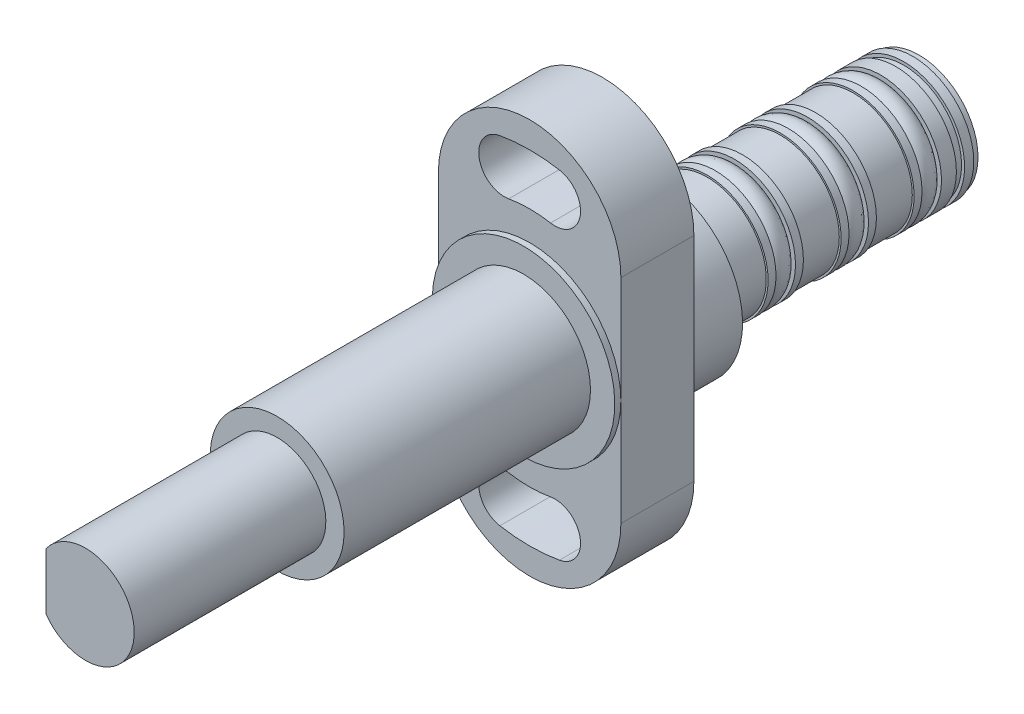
ISO-10303-21;
HEADER;
FILE_DESCRIPTION(('STEP AP214'),'2;1');
FILE_NAME('part.step','',(''),(''),'','','');
FILE_SCHEMA(('AUTOMOTIVE_DESIGN { 1 0 10303 214 1 1 1 1 }'));
ENDSEC;
DATA;
#1=APPLICATION_CONTEXT('core data for automotive mechanical design processes');
#2=APPLICATION_PROTOCOL_DEFINITION('international standard','automotive_design',2000,#1);
#3=PRODUCT_CONTEXT('',#1,'mechanical');
#4=PRODUCT('Part','Part','',(#3));
#5=PRODUCT_RELATED_PRODUCT_CATEGORY('part','',(#4));
#6=PRODUCT_DEFINITION_FORMATION('','',#4);
#7=PRODUCT_DEFINITION_CONTEXT('part definition',#1,'design');
#8=PRODUCT_DEFINITION('design','',#6,#7);
#9=PRODUCT_DEFINITION_SHAPE('','',#8);
#10=(LENGTH_UNIT() NAMED_UNIT(*) SI_UNIT(.MILLI.,.METRE.));
#11=(NAMED_UNIT(*) PLANE_ANGLE_UNIT() SI_UNIT($,.RADIAN.));
#12=(NAMED_UNIT(*) SI_UNIT($,.STERADIAN.) SOLID_ANGLE_UNIT());
#13=UNCERTAINTY_MEASURE_WITH_UNIT(LENGTH_MEASURE(1.E-05),#10,'distance_accuracy_value','');
#14=(GEOMETRIC_REPRESENTATION_CONTEXT(3) GLOBAL_UNCERTAINTY_ASSIGNED_CONTEXT((#13)) GLOBAL_UNIT_ASSIGNED_CONTEXT((#10,
#11,#12)) REPRESENTATION_CONTEXT('',''));
#15=CARTESIAN_POINT('',(0.,0.,0.));
#16=DIRECTION('',(0.,0.,1.));
#17=DIRECTION('',(1.,0.,0.));
#18=AXIS2_PLACEMENT_3D('',#15,#16,#17);
#19=CARTESIAN_POINT('',(-10.,0.,-54.5));
#20=DIRECTION('',(0.,0.,-1.));
#21=DIRECTION('',(-1.,0.,0.));
#22=AXIS2_PLACEMENT_3D('',#19,#20,#21);
#23=PLANE('',#22);
#24=CARTESIAN_POINT('',(0.,0.,-54.5));
#25=DIRECTION('',(0.,0.,1.));
#26=DIRECTION('',(1.,0.,0.));
#27=AXIS2_PLACEMENT_3D('',#24,#25,#26);
#28=CIRCLE('',#27,10.);
#29=CARTESIAN_POINT('',(10.,0.,-54.5));
#30=VERTEX_POINT('',#29);
#31=EDGE_CURVE('E1144',#30,#30,#28,.T.);
#32=ORIENTED_EDGE('',*,*,#31,.F.);
#33=EDGE_LOOP('',(#32));
#34=FACE_BOUND('',#33,.T.);
#35=CARTESIAN_POINT('',(3.75897878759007E-13,0.,-54.5000000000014));
#36=DIRECTION('',(0.,0.,-1.));
#37=DIRECTION('',(0.,-1.,0.));
#38=AXIS2_PLACEMENT_3D('',#35,#36,#37);
#39=CIRCLE('',#38,8.99999999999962);
#40=CARTESIAN_POINT('',(3.75897878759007E-13,-8.99999999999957,-54.5000000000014));
#41=VERTEX_POINT('',#40);
#42=EDGE_CURVE('E9',#41,#41,#39,.F.);
#43=ORIENTED_EDGE('',*,*,#42,.T.);
#44=EDGE_LOOP('',(#43));
#45=FACE_BOUND('',#44,.T.);
#46=ADVANCED_FACE('F14',(#34,#45),#23,.T.);
#47=CARTESIAN_POINT('',(-10.,0.,-51.));
#48=DIRECTION('',(-1.,0.,0.));
#49=DIRECTION('',(0.,0.,1.));
#50=AXIS2_PLACEMENT_3D('',#47,#48,#49);
#51=CYLINDRICAL_SURFACE('',#50,0.749999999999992);
#52=CARTESIAN_POINT('',(-6.54935453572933,0.,-51.));
#53=DIRECTION('',(-1.,0.,0.));
#54=DIRECTION('',(0.,0.,1.));
#55=AXIS2_PLACEMENT_3D('',#52,#53,#54);
#56=CIRCLE('',#55,0.749999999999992);
#57=CARTESIAN_POINT('',(-6.54935453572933,0.,-50.25));
#58=VERTEX_POINT('',#57);
#59=EDGE_CURVE('E1125',#58,#58,#56,.T.);
#60=ORIENTED_EDGE('',*,*,#59,.T.);
#61=EDGE_LOOP('',(#60));
#62=FACE_BOUND('',#61,.T.);
#63=CARTESIAN_POINT('',(-6.5,0.,-50.25));
#64=CARTESIAN_POINT('',(-6.49999945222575,0.0419781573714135,-50.2500017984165));
#65=CARTESIAN_POINT('',(-6.49958904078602,0.0839831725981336,-50.2535362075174));
#66=CARTESIAN_POINT('',(-6.497991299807,0.166826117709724,-50.2675808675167));
#67=CARTESIAN_POINT('',(-6.49680314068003,0.207662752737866,-50.2780985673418));
#68=CARTESIAN_POINT('',(-6.49378386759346,0.286957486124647,-50.3057973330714));
#69=CARTESIAN_POINT('',(-6.49195316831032,0.325417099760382,-50.3229741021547));
#70=CARTESIAN_POINT('',(-6.48785287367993,0.398899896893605,-50.3634944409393));
#71=CARTESIAN_POINT('',(-6.48558335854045,0.433923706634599,-50.3868368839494));
#72=CARTESIAN_POINT('',(-6.48084717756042,0.499713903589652,-50.4391440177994));
#73=CARTESIAN_POINT('',(-6.47837972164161,0.530461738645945,-50.4681319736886));
#74=CARTESIAN_POINT('',(-6.47353219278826,0.586667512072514,-50.5308574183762));
#75=CARTESIAN_POINT('',(-6.47115212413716,0.612125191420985,-50.5645951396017));
#76=CARTESIAN_POINT('',(-6.46674098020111,0.657095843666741,-50.6359813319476));
#77=CARTESIAN_POINT('',(-6.4647109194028,0.676591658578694,-50.6736406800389));
#78=CARTESIAN_POINT('',(-6.46123985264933,0.708975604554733,-50.7517260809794));
#79=CARTESIAN_POINT('',(-6.4597988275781,0.721863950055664,-50.7921520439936));
#80=CARTESIAN_POINT('',(-6.45767640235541,0.740611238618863,-50.8744317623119));
#81=CARTESIAN_POINT('',(-6.45699163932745,0.746501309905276,-50.9162783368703));
#82=CARTESIAN_POINT('',(-6.45644892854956,0.751181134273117,-51.0003712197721));
#83=CARTESIAN_POINT('',(-6.45659095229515,0.749971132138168,-51.0426175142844));
#84=CARTESIAN_POINT('',(-6.45768269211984,0.740510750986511,-51.1260946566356));
#85=CARTESIAN_POINT('',(-6.45862848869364,0.732294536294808,-51.1673294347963));
#86=CARTESIAN_POINT('',(-6.46121509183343,0.709108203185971,-51.2478309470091));
#87=CARTESIAN_POINT('',(-6.46285591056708,0.69413796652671,-51.2870976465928));
#88=CARTESIAN_POINT('',(-6.46665215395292,0.657831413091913,-51.362655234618));
#89=CARTESIAN_POINT('',(-6.46880878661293,0.636480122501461,-51.3989388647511));
#90=CARTESIAN_POINT('',(-6.47339269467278,0.588028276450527,-51.4674208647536));
#91=CARTESIAN_POINT('',(-6.47581998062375,0.560927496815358,-51.4996190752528));
#92=CARTESIAN_POINT('',(-6.48068914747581,0.501556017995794,-51.5592146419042));
#93=CARTESIAN_POINT('',(-6.48313103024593,0.469255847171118,-51.586582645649));
#94=CARTESIAN_POINT('',(-6.48774084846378,0.400504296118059,-51.6355128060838));
#95=CARTESIAN_POINT('',(-6.48990878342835,0.364052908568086,-51.6570749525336));
#96=CARTESIAN_POINT('',(-6.49372751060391,0.288011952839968,-51.6937808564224));
#97=CARTESIAN_POINT('',(-6.49537816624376,0.248421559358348,-51.7089229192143));
#98=CARTESIAN_POINT('',(-6.49797505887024,0.167236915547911,-51.7323362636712));
#99=CARTESIAN_POINT('',(-6.49892132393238,0.125642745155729,-51.7406078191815));
#100=CARTESIAN_POINT('',(-6.4999991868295,0.0418852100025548,-51.7500076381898));
#101=CARTESIAN_POINT('',(-6.50013539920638,-0.000273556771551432,-51.7511763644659));
#102=CARTESIAN_POINT('',(-6.4995902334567,-0.0841863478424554,-51.7464439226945));
#103=CARTESIAN_POINT('',(-6.49890887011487,-0.125940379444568,-51.7405428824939));
#104=CARTESIAN_POINT('',(-6.49680801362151,-0.20774013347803,-51.721872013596));
#105=CARTESIAN_POINT('',(-6.49539057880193,-0.247790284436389,-51.7091213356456));
#106=CARTESIAN_POINT('',(-6.49197639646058,-0.325183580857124,-51.6771329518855));
#107=CARTESIAN_POINT('',(-6.48997963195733,-0.362526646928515,-51.6578950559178));
#108=CARTESIAN_POINT('',(-6.48561818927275,-0.433627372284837,-51.6133794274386));
#109=CARTESIAN_POINT('',(-6.48325192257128,-0.467368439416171,-51.5880753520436));
#110=CARTESIAN_POINT('',(-6.4784215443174,-0.530138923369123,-51.5321831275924));
#111=CARTESIAN_POINT('',(-6.47595742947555,-0.559168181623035,-51.5015948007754));
#112=CARTESIAN_POINT('',(-6.4711949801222,-0.611833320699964,-51.435824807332));
#113=CARTESIAN_POINT('',(-6.46889750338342,-0.635442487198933,-51.4006216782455));
#114=CARTESIAN_POINT('',(-6.46474216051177,-0.676413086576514,-51.3267262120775));
#115=CARTESIAN_POINT('',(-6.46288428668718,-0.693774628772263,-51.2880339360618));
#116=CARTESIAN_POINT('',(-6.45982417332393,-0.72171329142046,-51.2083469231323));
#117=CARTESIAN_POINT('',(-6.45862044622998,-0.732305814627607,-51.1673576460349));
#118=CARTESIAN_POINT('',(-6.45700051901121,-0.746455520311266,-51.0841675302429));
#119=CARTESIAN_POINT('',(-6.45658428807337,-0.750012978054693,-51.0419667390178));
#120=CARTESIAN_POINT('',(-6.45658728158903,-0.749987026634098,-50.9578171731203));
#121=CARTESIAN_POINT('',(-6.45700159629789,-0.746445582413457,-50.9158683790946));
#122=CARTESIAN_POINT('',(-6.45860847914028,-0.732410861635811,-50.8331662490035));
#123=CARTESIAN_POINT('',(-6.45980104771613,-0.721917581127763,-50.7924129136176));
#124=CARTESIAN_POINT('',(-6.46282861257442,-0.694289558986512,-50.7132619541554));
#125=CARTESIAN_POINT('',(-6.46466344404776,-0.67715652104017,-50.6748637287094));
#126=CARTESIAN_POINT('',(-6.46876909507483,-0.636739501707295,-50.6014807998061));
#127=CARTESIAN_POINT('',(-6.47103991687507,-0.613455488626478,-50.5664961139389));
#128=CARTESIAN_POINT('',(-6.47577778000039,-0.561240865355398,-50.5007185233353));
#129=CARTESIAN_POINT('',(-6.47824586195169,-0.532278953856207,-50.4699505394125));
#130=CARTESIAN_POINT('',(-6.48309081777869,-0.469595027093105,-50.4136944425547));
#131=CARTESIAN_POINT('',(-6.48546766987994,-0.435871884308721,-50.3882075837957));
#132=CARTESIAN_POINT('',(-6.48987075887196,-0.3644984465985,-50.3431682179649));
#133=CARTESIAN_POINT('',(-6.49189582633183,-0.326835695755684,-50.3236353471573));
#134=CARTESIAN_POINT('',(-6.49535505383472,-0.248763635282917,-50.2911984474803));
#135=CARTESIAN_POINT('',(-6.49678986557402,-0.208357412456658,-50.2782871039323));
#136=CARTESIAN_POINT('',(-6.49855499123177,-0.139778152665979,-50.262603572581));
#137=CARTESIAN_POINT('',(-6.4990942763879,-0.11204015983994,-50.2578838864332));
#138=CARTESIAN_POINT('',(-6.49981696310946,-0.056205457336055,-50.2515815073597));
#139=CARTESIAN_POINT('',(-6.50000036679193,-0.0281087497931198,-50.2499987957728));
#140=CARTESIAN_POINT('',(-6.5,0.,-50.25));
#141=B_SPLINE_CURVE_WITH_KNOTS('',3,(#63,#64,#65,#66,#67,#68,#69,#70,#71,#72,#73,#74,#75,#76,
#77,#78,#79,#80,#81,#82,#83,#84,#85,#86,#87,#88,#89,#90,#91,#92,#93,#94,#95,#96,#97,#98,#99,
#100,#101,#102,#103,#104,#105,#106,#107,#108,#109,#110,#111,#112,#113,#114,#115,#116,#117,#118,
#119,#120,#121,#122,#123,#124,#125,#126,#127,#128,#129,#130,#131,#132,#133,#134,#135,#136,#137,
#138,#139,#140),.UNSPECIFIED.,.T.,.F.,(4,2,2,2,2,2,2,2,2,2,2,2,2,2,2,2,2,2,2,2,2,2,2,2,2,2,2,2,
2,2,2,2,2,2,2,2,2,2,4),(0.,0.125831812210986,0.251798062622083,0.377683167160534,
0.503545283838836,0.629937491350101,0.756335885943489,0.883094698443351,1.00984939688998,
1.13603815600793,1.26222256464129,1.38779515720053,1.51336994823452,1.63924175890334,
1.76511847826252,1.89173559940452,2.01835294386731,2.1450036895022,2.27164938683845,
2.39757293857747,2.52349421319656,2.64906524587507,2.77463995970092,2.90077019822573,
3.02690468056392,3.15364810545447,3.28038931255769,3.40684108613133,3.53328791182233,
3.65898945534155,3.78469107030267,3.91036045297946,4.03603048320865,4.16241384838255,
4.28882719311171,4.41565304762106,4.54233849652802,4.62659650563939,4.71085401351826),.UNSPECIFIED.);
#142=CARTESIAN_POINT('',(-6.5,0.,-50.25));
#143=VERTEX_POINT('',#142);
#144=EDGE_CURVE('E297',#143,#143,#141,.T.);
#145=ORIENTED_EDGE('',*,*,#144,.F.);
#146=EDGE_LOOP('',(#145));
#147=FACE_BOUND('',#146,.T.);
#148=ADVANCED_FACE('F309',(#62,#147),#51,.F.);
#149=CARTESIAN_POINT('',(0.,0.,-13.));
#150=DIRECTION('',(0.,0.,1.));
#151=DIRECTION('',(1.,0.,0.));
#152=AXIS2_PLACEMENT_3D('',#149,#150,#151);
#153=CYLINDRICAL_SURFACE('',#152,10.);
#154=ORIENTED_EDGE('',*,*,#31,.T.);
#155=EDGE_LOOP('',(#154));
#156=FACE_BOUND('',#155,.T.);
#157=CARTESIAN_POINT('',(0.,0.,-53.2));
#158=DIRECTION('',(0.,0.,-1.));
#159=DIRECTION('',(-1.,0.,0.));
#160=AXIS2_PLACEMENT_3D('',#157,#158,#159);
#161=CIRCLE('',#160,10.);
#162=CARTESIAN_POINT('',(-10.,0.,-53.2));
#163=VERTEX_POINT('',#162);
#164=EDGE_CURVE('E1180',#163,#163,#161,.T.);
#165=ORIENTED_EDGE('',*,*,#164,.T.);
#166=EDGE_LOOP('',(#165));
#167=FACE_BOUND('',#166,.T.);
#168=ADVANCED_FACE('F832',(#156,#167),#153,.T.);
#169=CARTESIAN_POINT('',(0.,0.,-45.7));
#170=DIRECTION('',(0.,0.,1.));
#171=DIRECTION('',(1.,0.,0.));
#172=AXIS2_PLACEMENT_3D('',#169,#170,#171);
#173=CIRCLE('',#172,10.);
#174=CARTESIAN_POINT('',(10.,0.,-45.7));
#175=VERTEX_POINT('',#174);
#176=EDGE_CURVE('E1141',#175,#175,#173,.T.);
#177=ORIENTED_EDGE('',*,*,#176,.F.);
#178=EDGE_LOOP('',(#177));
#179=FACE_BOUND('',#178,.T.);
#180=CARTESIAN_POINT('',(0.,0.,-47.));
#181=DIRECTION('',(0.,0.,-1.));
#182=DIRECTION('',(-1.,0.,0.));
#183=AXIS2_PLACEMENT_3D('',#180,#181,#182);
#184=CIRCLE('',#183,10.);
#185=CARTESIAN_POINT('',(-10.,0.,-47.));
#186=VERTEX_POINT('',#185);
#187=EDGE_CURVE('E1186',#186,#186,#184,.T.);
#188=ORIENTED_EDGE('',*,*,#187,.F.);
#189=EDGE_LOOP('',(#188));
#190=FACE_BOUND('',#189,.T.);
#191=ADVANCED_FACE('F353',(#179,#190),#153,.T.);
#192=CARTESIAN_POINT('',(-10.,0.,-51.));
#193=DIRECTION('',(-1.,0.,0.));
#194=DIRECTION('',(0.,0.,1.));
#195=AXIS2_PLACEMENT_3D('',#192,#193,#194);
#196=CYLINDRICAL_SURFACE('',#195,1.5);
#197=CARTESIAN_POINT('',(-7.,0.,-51.));
#198=DIRECTION('',(-1.,0.,0.));
#199=DIRECTION('',(0.,0.,1.));
#200=AXIS2_PLACEMENT_3D('',#197,#198,#199);
#201=CIRCLE('',#200,1.5);
#202=CARTESIAN_POINT('',(-7.,0.,-49.5));
#203=VERTEX_POINT('',#202);
#204=EDGE_CURVE('E1135',#203,#203,#201,.T.);
#205=ORIENTED_EDGE('',*,*,#204,.F.);
#206=EDGE_LOOP('',(#205));
#207=FACE_BOUND('',#206,.T.);
#208=CARTESIAN_POINT('',(-9.7,0.,-49.5));
#209=CARTESIAN_POINT('',(-9.69999863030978,-0.0837201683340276,-49.5000034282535));
#210=CARTESIAN_POINT('',(-9.69890478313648,-0.167488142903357,-49.5070327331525));
#211=CARTESIAN_POINT('',(-9.6946464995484,-0.332680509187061,-49.5349558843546));
#212=CARTESIAN_POINT('',(-9.69148007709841,-0.414102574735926,-49.555863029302));
#213=CARTESIAN_POINT('',(-9.68343229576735,-0.572188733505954,-49.6109004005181));
#214=CARTESIAN_POINT('',(-9.67855226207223,-0.648856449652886,-49.6450204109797));
#215=CARTESIAN_POINT('',(-9.6676157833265,-0.795367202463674,-49.7254895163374));
#216=CARTESIAN_POINT('',(-9.66155949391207,-0.865211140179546,-49.7718369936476));
#217=CARTESIAN_POINT('',(-9.6488873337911,-0.996681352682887,-49.8758541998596));
#218=CARTESIAN_POINT('',(-9.64226765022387,-1.05824292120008,-49.933605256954));
#219=CARTESIAN_POINT('',(-9.62924444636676,-1.17084243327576,-50.0586152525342));
#220=CARTESIAN_POINT('',(-9.62284093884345,-1.22187975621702,-50.1258747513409));
#221=CARTESIAN_POINT('',(-9.61093814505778,-1.31223592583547,-50.2684297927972));
#222=CARTESIAN_POINT('',(-9.60544378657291,-1.35149179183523,-50.3437657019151));
#223=CARTESIAN_POINT('',(-9.5960336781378,-1.41676816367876,-50.5000609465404));
#224=CARTESIAN_POINT('',(-9.59211783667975,-1.44278943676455,-50.5810199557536));
#225=CARTESIAN_POINT('',(-9.58634574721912,-1.48065622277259,-50.7455812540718));
#226=CARTESIAN_POINT('',(-9.58447337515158,-1.49261277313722,-50.8291574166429));
#227=CARTESIAN_POINT('',(-9.58295131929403,-1.50235477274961,-50.9971491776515));
#228=CARTESIAN_POINT('',(-9.58330149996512,-1.5001410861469,-51.0815647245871));
#229=CARTESIAN_POINT('',(-9.58617024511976,-1.48169611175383,-51.2480524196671));
#230=CARTESIAN_POINT('',(-9.58866963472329,-1.46558877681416,-51.3301386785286));
#231=CARTESIAN_POINT('',(-9.59552520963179,-1.42000790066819,-51.4904293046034));
#232=CARTESIAN_POINT('',(-9.59988145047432,-1.39053395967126,-51.5686335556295));
#233=CARTESIAN_POINT('',(-9.6099809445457,-1.31892848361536,-51.7193157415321));
#234=CARTESIAN_POINT('',(-9.61572990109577,-1.27674472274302,-51.7917684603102));
#235=CARTESIAN_POINT('',(-9.62796298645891,-1.180954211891,-51.9286140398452));
#236=CARTESIAN_POINT('',(-9.63444716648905,-1.12734666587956,-51.9930063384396));
#237=CARTESIAN_POINT('',(-9.6475046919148,-1.00955126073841,-52.1126213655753));
#238=CARTESIAN_POINT('',(-9.65407825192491,-0.945256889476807,-52.1677392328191));
#239=CARTESIAN_POINT('',(-9.66650986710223,-0.808275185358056,-52.2664187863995));
#240=CARTESIAN_POINT('',(-9.67236791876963,-0.735587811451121,-52.3099804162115));
#241=CARTESIAN_POINT('',(-9.68271515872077,-0.583790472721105,-52.3843174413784));
#242=CARTESIAN_POINT('',(-9.68720344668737,-0.504676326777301,-52.4150844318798));
#243=CARTESIAN_POINT('',(-9.69429801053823,-0.342319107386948,-52.4628660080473));
#244=CARTESIAN_POINT('',(-9.69690442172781,-0.259076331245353,-52.4798815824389));
#245=CARTESIAN_POINT('',(-9.69992356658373,-0.0917295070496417,-52.4995371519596));
#246=CARTESIAN_POINT('',(-9.70035828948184,-0.00764276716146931,-52.5023212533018));
#247=CARTESIAN_POINT('',(-9.69904503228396,0.159796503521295,-52.4938178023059));
#248=CARTESIAN_POINT('',(-9.69729712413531,0.243149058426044,-52.4825307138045));
#249=CARTESIAN_POINT('',(-9.69182860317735,0.406315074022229,-52.4463251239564));
#250=CARTESIAN_POINT('',(-9.68811819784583,0.486144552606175,-52.4214771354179));
#251=CARTESIAN_POINT('',(-9.67913927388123,0.640504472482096,-52.3589296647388));
#252=CARTESIAN_POINT('',(-9.67387067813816,0.715034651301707,-52.3212295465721));
#253=CARTESIAN_POINT('',(-9.66230595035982,0.857311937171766,-52.2337120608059));
#254=CARTESIAN_POINT('',(-9.65600222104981,0.92500241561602,-52.1838036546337));
#255=CARTESIAN_POINT('',(-9.64309168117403,1.05109843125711,-52.0734126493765));
#256=CARTESIAN_POINT('',(-9.63648485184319,1.10950339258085,-52.0129293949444));
#257=CARTESIAN_POINT('',(-9.62364264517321,1.21589746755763,-51.8824627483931));
#258=CARTESIAN_POINT('',(-9.61741107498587,1.2637897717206,-51.8123999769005));
#259=CARTESIAN_POINT('',(-9.60609335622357,1.34712527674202,-51.6651393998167));
#260=CARTESIAN_POINT('',(-9.60100717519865,1.38256883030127,-51.5879417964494));
#261=CARTESIAN_POINT('',(-9.59258394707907,1.43985208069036,-51.4288867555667));
#262=CARTESIAN_POINT('',(-9.58924045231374,1.4617419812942,-51.3470477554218));
#263=CARTESIAN_POINT('',(-9.58466427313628,1.49145587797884,-51.1807991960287));
#264=CARTESIAN_POINT('',(-9.58343143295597,1.49928091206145,-51.096389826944));
#265=CARTESIAN_POINT('',(-9.58322220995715,1.50061711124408,-50.928361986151));
#266=CARTESIAN_POINT('',(-9.58422182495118,1.49428053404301,-50.8447447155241));
#267=CARTESIAN_POINT('',(-9.58831259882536,1.46780045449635,-50.6797805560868));
#268=CARTESIAN_POINT('',(-9.59140375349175,1.44765697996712,-50.5984336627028));
#269=CARTESIAN_POINT('',(-9.59932072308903,1.39418996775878,-50.4403660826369));
#270=CARTESIAN_POINT('',(-9.60414504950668,1.36087773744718,-50.3636414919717));
#271=CARTESIAN_POINT('',(-9.61498648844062,1.28203409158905,-50.2168455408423));
#272=CARTESIAN_POINT('',(-9.6210036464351,1.23650221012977,-50.1467744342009));
#273=CARTESIAN_POINT('',(-9.63362965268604,1.13396117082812,-50.0145020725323));
#274=CARTESIAN_POINT('',(-9.64024392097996,1.07683943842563,-49.9523885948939));
#275=CARTESIAN_POINT('',(-9.65327418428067,0.952978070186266,-49.8385752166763));
#276=CARTESIAN_POINT('',(-9.65969013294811,0.886236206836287,-49.7868777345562));
#277=CARTESIAN_POINT('',(-9.67164407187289,0.744566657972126,-49.6950908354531));
#278=CARTESIAN_POINT('',(-9.67717668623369,0.669593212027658,-49.6550713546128));
#279=CARTESIAN_POINT('',(-9.68668801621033,0.513937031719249,-49.5882538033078));
#280=CARTESIAN_POINT('',(-9.69066832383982,0.433260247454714,-49.5614421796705));
#281=CARTESIAN_POINT('',(-9.69572866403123,0.293528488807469,-49.52781378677));
#282=CARTESIAN_POINT('',(-9.69732209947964,0.235331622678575,-49.5173997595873));
#283=CARTESIAN_POINT('',(-9.69945824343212,0.118097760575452,-49.5034917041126));
#284=CARTESIAN_POINT('',(-9.70000096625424,0.0590607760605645,-49.4999975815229));
#285=CARTESIAN_POINT('',(-9.7,0.,-49.5));
#286=B_SPLINE_CURVE_WITH_KNOTS('',3,(#208,#209,#210,#211,#212,#213,#214,#215,#216,#217,#218,
#219,#220,#221,#222,#223,#224,#225,#226,#227,#228,#229,#230,#231,#232,#233,#234,#235,#236,#237,
#238,#239,#240,#241,#242,#243,#244,#245,#246,#247,#248,#249,#250,#251,#252,#253,#254,#255,#256,
#257,#258,#259,#260,#261,#262,#263,#264,#265,#266,#267,#268,#269,#270,#271,#272,#273,#274,#275,
#276,#277,#278,#279,#280,#281,#282,#283,#284,#285),.UNSPECIFIED.,.T.,.F.,(4,2,2,2,2,2,2,2,2,2,2,
2,2,2,2,2,2,2,2,2,2,2,2,2,2,2,2,2,2,2,2,2,2,2,2,2,2,2,4),(0.,0.250944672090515,
0.502130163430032,0.7531218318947,1.0040803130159,1.25689781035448,1.50973021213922,
1.76389105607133,2.01803716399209,2.27016309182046,2.52227364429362,2.77215797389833,
3.02204977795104,3.27298274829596,3.52393320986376,3.77755395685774,4.03117594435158,
4.28496427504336,4.53873435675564,4.78992962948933,5.04111662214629,5.29100978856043,
5.54091532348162,5.79274450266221,6.04458929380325,6.29866411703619,6.5527317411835,
6.80585255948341,7.05895469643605,7.30934872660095,7.55974225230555,7.80992124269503,
8.06010977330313,8.31285600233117,8.56566084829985,8.81994997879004,9.07397762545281,
9.25101010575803,9.42804017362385),.UNSPECIFIED.);
#287=CARTESIAN_POINT('',(-9.7,0.,-49.5));
#288=VERTEX_POINT('',#287);
#289=EDGE_CURVE('E358',#288,#288,#286,.T.);
#290=ORIENTED_EDGE('',*,*,#289,.F.);
#291=EDGE_LOOP('',(#290));
#292=FACE_BOUND('',#291,.T.);
#293=ADVANCED_FACE('F348',(#207,#292),#196,.F.);
#294=CARTESIAN_POINT('',(-7.,0.,-51.));
#295=DIRECTION('',(-1.,0.,0.));
#296=DIRECTION('',(0.,0.,1.));
#297=AXIS2_PLACEMENT_3D('',#294,#295,#296);
#298=CONICAL_SURFACE('',#297,1.5,1.02974425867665);
#299=ORIENTED_EDGE('',*,*,#204,.T.);
#300=EDGE_LOOP('',(#299));
#301=FACE_BOUND('',#300,.T.);
#302=ORIENTED_EDGE('',*,*,#59,.F.);
#303=EDGE_LOOP('',(#302));
#304=FACE_BOUND('',#303,.T.);
#305=ADVANCED_FACE('F344',(#301,#304),#298,.F.);
#306=CARTESIAN_POINT('',(-10.,0.,-45.7));
#307=DIRECTION('',(0.,0.,1.));
#308=DIRECTION('',(1.,0.,0.));
#309=AXIS2_PLACEMENT_3D('',#306,#307,#308);
#310=PLANE('',#309);
#311=CARTESIAN_POINT('',(3.7590512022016E-13,0.,-45.7000000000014));
#312=DIRECTION('',(0.,0.,-1.));
#313=DIRECTION('',(0.,-1.,0.));
#314=AXIS2_PLACEMENT_3D('',#311,#312,#313);
#315=CIRCLE('',#314,9.);
#316=CARTESIAN_POINT('',(3.7590512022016E-13,-8.99999999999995,-45.7000000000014));
#317=VERTEX_POINT('',#316);
#318=EDGE_CURVE('E417',#317,#317,#315,.T.);
#319=ORIENTED_EDGE('',*,*,#318,.T.);
#320=EDGE_LOOP('',(#319));
#321=FACE_BOUND('',#320,.T.);
#322=ORIENTED_EDGE('',*,*,#176,.T.);
#323=EDGE_LOOP('',(#322));
#324=FACE_BOUND('',#323,.T.);
#325=ADVANCED_FACE('F347',(#321,#324),#310,.T.);
#326=CARTESIAN_POINT('',(0.,0.,-13.));
#327=DIRECTION('',(0.,0.,1.));
#328=DIRECTION('',(1.,0.,0.));
#329=AXIS2_PLACEMENT_3D('',#326,#327,#328);
#330=CYLINDRICAL_SURFACE('',#329,9.7);
#331=CARTESIAN_POINT('',(0.,0.,-47.));
#332=DIRECTION('',(0.,0.,1.));
#333=DIRECTION('',(1.,0.,0.));
#334=AXIS2_PLACEMENT_3D('',#331,#332,#333);
#335=CIRCLE('',#334,9.7);
#336=CARTESIAN_POINT('',(9.7,0.,-47.));
#337=VERTEX_POINT('',#336);
#338=EDGE_CURVE('E366',#337,#337,#335,.T.);
#339=ORIENTED_EDGE('',*,*,#338,.F.);
#340=EDGE_LOOP('',(#339));
#341=FACE_BOUND('',#340,.T.);
#342=CARTESIAN_POINT('',(0.,0.,-53.2));
#343=DIRECTION('',(0.,0.,-1.));
#344=DIRECTION('',(-1.,0.,0.));
#345=AXIS2_PLACEMENT_3D('',#342,#343,#344);
#346=CIRCLE('',#345,9.7);
#347=CARTESIAN_POINT('',(-9.7,0.,-53.2));
#348=VERTEX_POINT('',#347);
#349=EDGE_CURVE('E1178',#348,#348,#346,.T.);
#350=ORIENTED_EDGE('',*,*,#349,.F.);
#351=EDGE_LOOP('',(#350));
#352=FACE_BOUND('',#351,.T.);
#353=ORIENTED_EDGE('',*,*,#289,.T.);
#354=EDGE_LOOP('',(#353));
#355=FACE_BOUND('',#354,.T.);
#356=ADVANCED_FACE('F376',(#341,#352,#355),#330,.T.);
#357=CARTESIAN_POINT('',(0.,9.7,-47.));
#358=DIRECTION('',(0.,0.,1.));
#359=DIRECTION('',(1.,0.,0.));
#360=AXIS2_PLACEMENT_3D('',#357,#358,#359);
#361=PLANE('',#360);
#362=ORIENTED_EDGE('',*,*,#338,.T.);
#363=EDGE_LOOP('',(#362));
#364=FACE_BOUND('',#363,.T.);
#365=ORIENTED_EDGE('',*,*,#187,.T.);
#366=EDGE_LOOP('',(#365));
#367=FACE_BOUND('',#366,.T.);
#368=ADVANCED_FACE('F380',(#364,#367),#361,.F.);
#369=CARTESIAN_POINT('',(0.,10.,-53.2));
#370=DIRECTION('',(0.,0.,-1.));
#371=DIRECTION('',(-1.,0.,0.));
#372=AXIS2_PLACEMENT_3D('',#369,#370,#371);
#373=PLANE('',#372);
#374=ORIENTED_EDGE('',*,*,#164,.F.);
#375=EDGE_LOOP('',(#374));
#376=FACE_BOUND('',#375,.T.);
#377=ORIENTED_EDGE('',*,*,#349,.T.);
#378=EDGE_LOOP('',(#377));
#379=FACE_BOUND('',#378,.T.);
#380=ADVANCED_FACE('F319',(#376,#379),#373,.F.);
#381=CARTESIAN_POINT('',(0.,0.,-13.));
#382=DIRECTION('',(0.,0.,-1.));
#383=DIRECTION('',(-1.,0.,0.));
#384=AXIS2_PLACEMENT_3D('',#381,#382,#383);
#385=CYLINDRICAL_SURFACE('',#384,6.5);
#386=ORIENTED_EDGE('',*,*,#144,.T.);
#387=EDGE_LOOP('',(#386));
#388=FACE_BOUND('',#387,.T.);
#389=ADVANCED_FACE('F313',(#388),#385,.T.);
#390=CARTESIAN_POINT('',(8.99989452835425,0.0435715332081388,-44.1000000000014));
#391=DIRECTION('',(-0.00484128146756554,0.999988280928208,0.));
#392=DIRECTION('',(0.,0.,1.));
#393=AXIS2_PLACEMENT_3D('',#390,#391,#392);
#394=ELLIPSE('',#393,1.6,1.);
#395=CARTESIAN_POINT('',(3.7590512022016E-13,0.,-45.7000000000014));
#396=DIRECTION('',(0.,0.,-1.));
#397=AXIS1_PLACEMENT('',#395,#396);
#398=SURFACE_OF_REVOLUTION('',#394,#397);
#399=CARTESIAN_POINT('',(3.75907017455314E-13,0.,-42.5000000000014));
#400=DIRECTION('',(0.,0.,-1.));
#401=DIRECTION('',(0.,-1.,0.));
#402=AXIS2_PLACEMENT_3D('',#399,#400,#401);
#403=CIRCLE('',#402,9.);
#404=CARTESIAN_POINT('',(3.75907017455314E-13,-8.99999999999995,-42.5000000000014));
#405=VERTEX_POINT('',#404);
#406=EDGE_CURVE('E415',#405,#405,#403,.T.);
#407=ORIENTED_EDGE('',*,*,#406,.T.);
#408=EDGE_LOOP('',(#407));
#409=FACE_BOUND('',#408,.T.);
#410=ORIENTED_EDGE('',*,*,#318,.F.);
#411=EDGE_LOOP('',(#410));
#412=FACE_BOUND('',#411,.T.);
#413=ADVANCED_FACE('F318',(#409,#412),#398,.T.);
#414=CARTESIAN_POINT('',(0.,0.,-13.));
#415=DIRECTION('',(0.,0.,1.));
#416=DIRECTION('',(1.,0.,0.));
#417=AXIS2_PLACEMENT_3D('',#414,#415,#416);
#418=CYLINDRICAL_SURFACE('',#417,9.7);
#419=CARTESIAN_POINT('',(0.,0.,-21.));
#420=DIRECTION('',(0.,0.,-1.));
#421=DIRECTION('',(-1.,0.,0.));
#422=AXIS2_PLACEMENT_3D('',#419,#420,#421);
#423=CIRCLE('',#422,9.7);
#424=CARTESIAN_POINT('',(-9.7,0.,-21.));
#425=VERTEX_POINT('',#424);
#426=EDGE_CURVE('E273',#425,#425,#423,.F.);
#427=ORIENTED_EDGE('',*,*,#426,.F.);
#428=EDGE_LOOP('',(#427));
#429=FACE_BOUND('',#428,.T.);
#430=CARTESIAN_POINT('',(0.,0.,-29.2));
#431=DIRECTION('',(0.,0.,-1.));
#432=DIRECTION('',(-1.,0.,0.));
#433=AXIS2_PLACEMENT_3D('',#430,#431,#432);
#434=CIRCLE('',#433,9.7);
#435=CARTESIAN_POINT('',(-9.7,0.,-29.2));
#436=VERTEX_POINT('',#435);
#437=EDGE_CURVE('E1197',#436,#436,#434,.T.);
#438=ORIENTED_EDGE('',*,*,#437,.F.);
#439=EDGE_LOOP('',(#438));
#440=FACE_BOUND('',#439,.T.);
#441=ADVANCED_FACE('F783',(#429,#440),#418,.T.);
#442=CARTESIAN_POINT('',(0.,10.,-29.2));
#443=DIRECTION('',(0.,0.,-1.));
#444=DIRECTION('',(-1.,0.,0.));
#445=AXIS2_PLACEMENT_3D('',#442,#443,#444);
#446=PLANE('',#445);
#447=CARTESIAN_POINT('',(0.,0.,-29.2));
#448=DIRECTION('',(0.,0.,-1.));
#449=DIRECTION('',(-1.,0.,0.));
#450=AXIS2_PLACEMENT_3D('',#447,#448,#449);
#451=CIRCLE('',#450,10.);
#452=CARTESIAN_POINT('',(-10.,0.,-29.2));
#453=VERTEX_POINT('',#452);
#454=EDGE_CURVE('E368',#453,#453,#451,.T.);
#455=ORIENTED_EDGE('',*,*,#454,.F.);
#456=EDGE_LOOP('',(#455));
#457=FACE_BOUND('',#456,.T.);
#458=ORIENTED_EDGE('',*,*,#437,.T.);
#459=EDGE_LOOP('',(#458));
#460=FACE_BOUND('',#459,.T.);
#461=ADVANCED_FACE('F774',(#457,#460),#446,.F.);
#462=CARTESIAN_POINT('',(0.,0.,-30.5));
#463=DIRECTION('',(0.,0.,1.));
#464=DIRECTION('',(1.,0.,0.));
#465=AXIS2_PLACEMENT_3D('',#462,#463,#464);
#466=CIRCLE('',#465,10.);
#467=CARTESIAN_POINT('',(10.,0.,-30.5));
#468=VERTEX_POINT('',#467);
#469=EDGE_CURVE('E1126',#468,#468,#466,.T.);
#470=ORIENTED_EDGE('',*,*,#469,.T.);
#471=EDGE_LOOP('',(#470));
#472=FACE_BOUND('',#471,.T.);
#473=ORIENTED_EDGE('',*,*,#454,.T.);
#474=EDGE_LOOP('',(#473));
#475=FACE_BOUND('',#474,.T.);
#476=ADVANCED_FACE('F684',(#472,#475),#153,.T.);
#477=CARTESIAN_POINT('',(-10.,0.,-30.5));
#478=DIRECTION('',(0.,0.,-1.));
#479=DIRECTION('',(-1.,0.,0.));
#480=AXIS2_PLACEMENT_3D('',#477,#478,#479);
#481=PLANE('',#480);
#482=ORIENTED_EDGE('',*,*,#469,.F.);
#483=EDGE_LOOP('',(#482));
#484=FACE_BOUND('',#483,.T.);
#485=CARTESIAN_POINT('',(3.75912752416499E-13,0.,-30.5000000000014));
#486=DIRECTION('',(0.,0.,-1.));
#487=DIRECTION('',(0.,-1.,0.));
#488=AXIS2_PLACEMENT_3D('',#485,#486,#487);
#489=CIRCLE('',#488,9.);
#490=CARTESIAN_POINT('',(3.75912752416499E-13,-8.99999999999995,-30.5000000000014));
#491=VERTEX_POINT('',#490);
#492=EDGE_CURVE('E305',#491,#491,#489,.T.);
#493=ORIENTED_EDGE('',*,*,#492,.F.);
#494=EDGE_LOOP('',(#493));
#495=FACE_BOUND('',#494,.T.);
#496=ADVANCED_FACE('F755',(#484,#495),#481,.T.);
#497=CARTESIAN_POINT('',(-6.5,0.,-36.25));
#498=CARTESIAN_POINT('',(-6.49999945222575,0.0419781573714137,-36.2500017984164));
#499=CARTESIAN_POINT('',(-6.49958904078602,0.0839831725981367,-36.2535362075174));
#500=CARTESIAN_POINT('',(-6.497991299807,0.166826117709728,-36.2675808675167));
#501=CARTESIAN_POINT('',(-6.49680314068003,0.207662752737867,-36.2780985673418));
#502=CARTESIAN_POINT('',(-6.49378386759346,0.286957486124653,-36.3057973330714));
#503=CARTESIAN_POINT('',(-6.49195316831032,0.325417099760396,-36.3229741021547));
#504=CARTESIAN_POINT('',(-6.48785287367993,0.398899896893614,-36.3634944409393));
#505=CARTESIAN_POINT('',(-6.48558335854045,0.433923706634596,-36.3868368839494));
#506=CARTESIAN_POINT('',(-6.48084717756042,0.499713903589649,-36.4391440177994));
#507=CARTESIAN_POINT('',(-6.47837972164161,0.530461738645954,-36.4681319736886));
#508=CARTESIAN_POINT('',(-6.47353219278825,0.586667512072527,-36.5308574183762));
#509=CARTESIAN_POINT('',(-6.47115212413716,0.612125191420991,-36.5645951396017));
#510=CARTESIAN_POINT('',(-6.46674098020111,0.657095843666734,-36.6359813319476));
#511=CARTESIAN_POINT('',(-6.4647109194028,0.676591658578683,-36.6736406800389));
#512=CARTESIAN_POINT('',(-6.46123985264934,0.708975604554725,-36.7517260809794));
#513=CARTESIAN_POINT('',(-6.4597988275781,0.721863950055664,-36.7921520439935));
#514=CARTESIAN_POINT('',(-6.4576764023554,0.740611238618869,-36.8744317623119));
#515=CARTESIAN_POINT('',(-6.45699163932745,0.746501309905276,-36.9162783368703));
#516=CARTESIAN_POINT('',(-6.45644892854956,0.751181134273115,-37.0003712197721));
#517=CARTESIAN_POINT('',(-6.45659095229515,0.749971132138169,-37.0426175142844));
#518=CARTESIAN_POINT('',(-6.45768269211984,0.74051075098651,-37.1260946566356));
#519=CARTESIAN_POINT('',(-6.45862848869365,0.732294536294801,-37.1673294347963));
#520=CARTESIAN_POINT('',(-6.46121509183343,0.709108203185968,-37.2478309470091));
#521=CARTESIAN_POINT('',(-6.46285591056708,0.694137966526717,-37.2870976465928));
#522=CARTESIAN_POINT('',(-6.46665215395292,0.657831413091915,-37.3626552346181));
#523=CARTESIAN_POINT('',(-6.46880878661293,0.636480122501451,-37.3989388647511));
#524=CARTESIAN_POINT('',(-6.47339269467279,0.588028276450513,-37.4674208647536));
#525=CARTESIAN_POINT('',(-6.47581998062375,0.560927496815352,-37.4996190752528));
#526=CARTESIAN_POINT('',(-6.48068914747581,0.501556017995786,-37.5592146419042));
#527=CARTESIAN_POINT('',(-6.48313103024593,0.4692558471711,-37.586582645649));
#528=CARTESIAN_POINT('',(-6.48774084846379,0.400504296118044,-37.6355128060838));
#529=CARTESIAN_POINT('',(-6.48990878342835,0.364052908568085,-37.6570749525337));
#530=CARTESIAN_POINT('',(-6.49372751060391,0.288011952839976,-37.6937808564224));
#531=CARTESIAN_POINT('',(-6.49537816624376,0.248421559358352,-37.7089229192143));
#532=CARTESIAN_POINT('',(-6.49797505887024,0.16723691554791,-37.7323362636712));
#533=CARTESIAN_POINT('',(-6.49892132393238,0.125642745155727,-37.7406078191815));
#534=CARTESIAN_POINT('',(-6.4999991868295,0.0418852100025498,-37.7500076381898));
#535=CARTESIAN_POINT('',(-6.50013539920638,-0.000273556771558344,-37.7511763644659));
#536=CARTESIAN_POINT('',(-6.4995902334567,-0.0841863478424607,-37.7464439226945));
#537=CARTESIAN_POINT('',(-6.49890887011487,-0.12594037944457,-37.7405428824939));
#538=CARTESIAN_POINT('',(-6.49680801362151,-0.207740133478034,-37.721872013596));
#539=CARTESIAN_POINT('',(-6.49539057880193,-0.247790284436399,-37.7091213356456));
#540=CARTESIAN_POINT('',(-6.49197639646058,-0.32518358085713,-37.6771329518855));
#541=CARTESIAN_POINT('',(-6.48997963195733,-0.36252664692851,-37.6578950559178));
#542=CARTESIAN_POINT('',(-6.48561818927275,-0.433627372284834,-37.6133794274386));
#543=CARTESIAN_POINT('',(-6.48325192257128,-0.467368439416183,-37.5880753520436));
#544=CARTESIAN_POINT('',(-6.4784215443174,-0.53013892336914,-37.5321831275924));
#545=CARTESIAN_POINT('',(-6.47595742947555,-0.559168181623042,-37.5015948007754));
#546=CARTESIAN_POINT('',(-6.4711949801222,-0.611833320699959,-37.435824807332));
#547=CARTESIAN_POINT('',(-6.46889750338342,-0.635442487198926,-37.4006216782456));
#548=CARTESIAN_POINT('',(-6.46474216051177,-0.67641308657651,-37.3267262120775));
#549=CARTESIAN_POINT('',(-6.46288428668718,-0.693774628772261,-37.2880339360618));
#550=CARTESIAN_POINT('',(-6.45982417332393,-0.721713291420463,-37.2083469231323));
#551=CARTESIAN_POINT('',(-6.45862044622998,-0.732305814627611,-37.1673576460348));
#552=CARTESIAN_POINT('',(-6.4570005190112,-0.746455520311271,-37.0841675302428));
#553=CARTESIAN_POINT('',(-6.45658428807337,-0.750012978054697,-37.0419667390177));
#554=CARTESIAN_POINT('',(-6.45658728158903,-0.749987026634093,-36.9578171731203));
#555=CARTESIAN_POINT('',(-6.45700159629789,-0.746445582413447,-36.9158683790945));
#556=CARTESIAN_POINT('',(-6.45860847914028,-0.732410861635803,-36.8331662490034));
#557=CARTESIAN_POINT('',(-6.45980104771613,-0.721917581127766,-36.7924129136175));
#558=CARTESIAN_POINT('',(-6.46282861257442,-0.694289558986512,-36.7132619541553));
#559=CARTESIAN_POINT('',(-6.46466344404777,-0.677156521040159,-36.6748637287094));
#560=CARTESIAN_POINT('',(-6.46876909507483,-0.636739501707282,-36.6014807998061));
#561=CARTESIAN_POINT('',(-6.47103991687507,-0.613455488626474,-36.5664961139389));
#562=CARTESIAN_POINT('',(-6.47577778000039,-0.561240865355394,-36.5007185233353));
#563=CARTESIAN_POINT('',(-6.47824586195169,-0.532278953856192,-36.4699505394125));
#564=CARTESIAN_POINT('',(-6.48309081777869,-0.469595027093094,-36.4136944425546));
#565=CARTESIAN_POINT('',(-6.48546766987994,-0.435871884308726,-36.3882075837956));
#566=CARTESIAN_POINT('',(-6.48987075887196,-0.364498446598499,-36.3431682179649));
#567=CARTESIAN_POINT('',(-6.49189582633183,-0.326835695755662,-36.3236353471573));
#568=CARTESIAN_POINT('',(-6.49535505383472,-0.248763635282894,-36.2911984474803));
#569=CARTESIAN_POINT('',(-6.49678986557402,-0.208357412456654,-36.2782871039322));
#570=CARTESIAN_POINT('',(-6.49855499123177,-0.139778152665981,-36.2626035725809));
#571=CARTESIAN_POINT('',(-6.4990942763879,-0.112040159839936,-36.2578838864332));
#572=CARTESIAN_POINT('',(-6.49981696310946,-0.0562054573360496,-36.2515815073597));
#573=CARTESIAN_POINT('',(-6.50000036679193,-0.0281087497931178,-36.2499987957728));
#574=CARTESIAN_POINT('',(-6.5,0.,-36.25));
#575=B_SPLINE_CURVE_WITH_KNOTS('',3,(#497,#498,#499,#500,#501,#502,#503,#504,#505,#506,#507,
#508,#509,#510,#511,#512,#513,#514,#515,#516,#517,#518,#519,#520,#521,#522,#523,#524,#525,#526,
#527,#528,#529,#530,#531,#532,#533,#534,#535,#536,#537,#538,#539,#540,#541,#542,#543,#544,#545,
#546,#547,#548,#549,#550,#551,#552,#553,#554,#555,#556,#557,#558,#559,#560,#561,#562,#563,#564,
#565,#566,#567,#568,#569,#570,#571,#572,#573,#574),.UNSPECIFIED.,.T.,.F.,(4,2,2,2,2,2,2,2,2,2,2,
2,2,2,2,2,2,2,2,2,2,2,2,2,2,2,2,2,2,2,2,2,2,2,2,2,2,2,4),(0.,0.125831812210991,
0.251798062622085,0.377683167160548,0.503545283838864,0.629937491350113,0.756335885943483,
0.883094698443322,1.00984939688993,1.1360381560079,1.26222256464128,1.38779515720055,
1.51336994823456,1.63924175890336,1.76511847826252,1.89173559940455,2.01835294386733,
2.1450036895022,2.27164938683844,2.39757293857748,2.52349421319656,2.64906524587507,
2.77463995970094,2.90077019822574,3.02690468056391,3.15364810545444,3.28038931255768,
3.40684108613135,3.53328791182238,3.6589894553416,3.78469107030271,3.91036045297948,
4.03603048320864,4.16241384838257,4.28882719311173,4.4156530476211,4.54233849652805,
4.62659650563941,4.71085401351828),.UNSPECIFIED.);
#576=CARTESIAN_POINT('',(-6.5,0.,-36.25));
#577=VERTEX_POINT('',#576);
#578=EDGE_CURVE('E306',#577,#577,#575,.T.);
#579=ORIENTED_EDGE('',*,*,#578,.T.);
#580=EDGE_LOOP('',(#579));
#581=FACE_BOUND('',#580,.T.);
#582=ADVANCED_FACE('F321',(#581),#385,.T.);
#583=CARTESIAN_POINT('',(8.99989452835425,0.0435715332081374,-32.1000000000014));
#584=DIRECTION('',(-0.00484128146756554,0.999988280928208,0.));
#585=DIRECTION('',(0.,0.,1.));
#586=AXIS2_PLACEMENT_3D('',#583,#584,#585);
#587=ELLIPSE('',#586,1.6,1.);
#588=CARTESIAN_POINT('',(3.75910855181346E-13,0.,-33.7000000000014));
#589=DIRECTION('',(0.,0.,-1.));
#590=AXIS1_PLACEMENT('',#588,#589);
#591=SURFACE_OF_REVOLUTION('',#587,#590);
#592=ORIENTED_EDGE('',*,*,#492,.T.);
#593=EDGE_LOOP('',(#592));
#594=FACE_BOUND('',#593,.T.);
#595=CARTESIAN_POINT('',(3.75910855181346E-13,0.,-33.7000000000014));
#596=DIRECTION('',(0.,0.,-1.));
#597=DIRECTION('',(0.,-1.,0.));
#598=AXIS2_PLACEMENT_3D('',#595,#596,#597);
#599=CIRCLE('',#598,9.);
#600=CARTESIAN_POINT('',(3.75910855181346E-13,-8.99999999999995,-33.7000000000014));
#601=VERTEX_POINT('',#600);
#602=EDGE_CURVE('E412',#601,#601,#599,.T.);
#603=ORIENTED_EDGE('',*,*,#602,.F.);
#604=EDGE_LOOP('',(#603));
#605=FACE_BOUND('',#604,.T.);
#606=ADVANCED_FACE('F342',(#594,#605),#591,.T.);
#607=CARTESIAN_POINT('',(-10.,0.,-37.));
#608=DIRECTION('',(-1.,0.,0.));
#609=DIRECTION('',(0.,0.,1.));
#610=AXIS2_PLACEMENT_3D('',#607,#608,#609);
#611=CYLINDRICAL_SURFACE('',#610,0.749999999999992);
#612=CARTESIAN_POINT('',(-6.54935453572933,0.,-37.));
#613=DIRECTION('',(-1.,0.,0.));
#614=DIRECTION('',(0.,0.,1.));
#615=AXIS2_PLACEMENT_3D('',#612,#613,#614);
#616=CIRCLE('',#615,0.749999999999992);
#617=CARTESIAN_POINT('',(-6.54935453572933,0.,-36.25));
#618=VERTEX_POINT('',#617);
#619=EDGE_CURVE('E1129',#618,#618,#616,.T.);
#620=ORIENTED_EDGE('',*,*,#619,.T.);
#621=EDGE_LOOP('',(#620));
#622=FACE_BOUND('',#621,.T.);
#623=ORIENTED_EDGE('',*,*,#578,.F.);
#624=EDGE_LOOP('',(#623));
#625=FACE_BOUND('',#624,.T.);
#626=ADVANCED_FACE('F337',(#622,#625),#611,.F.);
#627=CARTESIAN_POINT('',(-10.,0.,-33.7));
#628=DIRECTION('',(0.,0.,1.));
#629=DIRECTION('',(1.,0.,0.));
#630=AXIS2_PLACEMENT_3D('',#627,#628,#629);
#631=PLANE('',#630);
#632=ORIENTED_EDGE('',*,*,#602,.T.);
#633=EDGE_LOOP('',(#632));
#634=FACE_BOUND('',#633,.T.);
#635=CARTESIAN_POINT('',(0.,0.,-33.7));
#636=DIRECTION('',(0.,0.,1.));
#637=DIRECTION('',(1.,0.,0.));
#638=AXIS2_PLACEMENT_3D('',#635,#636,#637);
#639=CIRCLE('',#638,10.);
#640=CARTESIAN_POINT('',(10.,0.,-33.7));
#641=VERTEX_POINT('',#640);
#642=EDGE_CURVE('E1146',#641,#641,#639,.T.);
#643=ORIENTED_EDGE('',*,*,#642,.T.);
#644=EDGE_LOOP('',(#643));
#645=FACE_BOUND('',#644,.T.);
#646=ADVANCED_FACE('F341',(#634,#645),#631,.T.);
#647=CARTESIAN_POINT('',(-7.,0.,-37.));
#648=DIRECTION('',(-1.,0.,0.));
#649=DIRECTION('',(0.,0.,1.));
#650=AXIS2_PLACEMENT_3D('',#647,#648,#649);
#651=CONICAL_SURFACE('',#650,1.5,1.02974425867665);
#652=CARTESIAN_POINT('',(-7.,0.,-37.));
#653=DIRECTION('',(-1.,0.,0.));
#654=DIRECTION('',(0.,0.,1.));
#655=AXIS2_PLACEMENT_3D('',#652,#653,#654);
#656=CIRCLE('',#655,1.5);
#657=CARTESIAN_POINT('',(-7.,0.,-35.5));
#658=VERTEX_POINT('',#657);
#659=EDGE_CURVE('E1138',#658,#658,#656,.T.);
#660=ORIENTED_EDGE('',*,*,#659,.T.);
#661=EDGE_LOOP('',(#660));
#662=FACE_BOUND('',#661,.T.);
#663=ORIENTED_EDGE('',*,*,#619,.F.);
#664=EDGE_LOOP('',(#663));
#665=FACE_BOUND('',#664,.T.);
#666=ADVANCED_FACE('F355',(#662,#665),#651,.F.);
#667=ORIENTED_EDGE('',*,*,#642,.F.);
#668=EDGE_LOOP('',(#667));
#669=FACE_BOUND('',#668,.T.);
#670=CARTESIAN_POINT('',(0.,0.,-35.));
#671=DIRECTION('',(0.,0.,-1.));
#672=DIRECTION('',(-1.,0.,0.));
#673=AXIS2_PLACEMENT_3D('',#670,#671,#672);
#674=CIRCLE('',#673,10.);
#675=CARTESIAN_POINT('',(-10.,0.,-35.));
#676=VERTEX_POINT('',#675);
#677=EDGE_CURVE('E1195',#676,#676,#674,.T.);
#678=ORIENTED_EDGE('',*,*,#677,.F.);
#679=EDGE_LOOP('',(#678));
#680=FACE_BOUND('',#679,.T.);
#681=ADVANCED_FACE('F685',(#669,#680),#153,.T.);
#682=CARTESIAN_POINT('',(-10.,0.,-37.));
#683=DIRECTION('',(-1.,0.,0.));
#684=DIRECTION('',(0.,0.,1.));
#685=AXIS2_PLACEMENT_3D('',#682,#683,#684);
#686=CYLINDRICAL_SURFACE('',#685,1.5);
#687=ORIENTED_EDGE('',*,*,#659,.F.);
#688=EDGE_LOOP('',(#687));
#689=FACE_BOUND('',#688,.T.);
#690=CARTESIAN_POINT('',(-9.7,0.,-35.5));
#691=CARTESIAN_POINT('',(-9.69999863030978,-0.083720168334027,-35.5000034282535));
#692=CARTESIAN_POINT('',(-9.69890478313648,-0.167488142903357,-35.5070327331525));
#693=CARTESIAN_POINT('',(-9.6946464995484,-0.332680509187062,-35.5349558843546));
#694=CARTESIAN_POINT('',(-9.69148007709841,-0.414102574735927,-35.555863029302));
#695=CARTESIAN_POINT('',(-9.68343229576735,-0.572188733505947,-35.6109004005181));
#696=CARTESIAN_POINT('',(-9.67855226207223,-0.648856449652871,-35.6450204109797));
#697=CARTESIAN_POINT('',(-9.6676157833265,-0.795367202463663,-35.7254895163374));
#698=CARTESIAN_POINT('',(-9.66155949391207,-0.865211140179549,-35.7718369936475));
#699=CARTESIAN_POINT('',(-9.6488873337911,-0.996681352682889,-35.8758541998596));
#700=CARTESIAN_POINT('',(-9.64226765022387,-1.05824292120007,-35.933605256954));
#701=CARTESIAN_POINT('',(-9.62924444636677,-1.17084243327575,-36.0586152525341));
#702=CARTESIAN_POINT('',(-9.62284093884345,-1.22187975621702,-36.1258747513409));
#703=CARTESIAN_POINT('',(-9.61093814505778,-1.31223592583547,-36.2684297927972));
#704=CARTESIAN_POINT('',(-9.60544378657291,-1.35149179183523,-36.3437657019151));
#705=CARTESIAN_POINT('',(-9.5960336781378,-1.41676816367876,-36.5000609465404));
#706=CARTESIAN_POINT('',(-9.59211783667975,-1.44278943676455,-36.5810199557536));
#707=CARTESIAN_POINT('',(-9.58634574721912,-1.48065622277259,-36.7455812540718));
#708=CARTESIAN_POINT('',(-9.58447337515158,-1.49261277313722,-36.8291574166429));
#709=CARTESIAN_POINT('',(-9.58295131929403,-1.50235477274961,-36.9971491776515));
#710=CARTESIAN_POINT('',(-9.58330149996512,-1.5001410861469,-37.0815647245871));
#711=CARTESIAN_POINT('',(-9.58617024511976,-1.48169611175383,-37.2480524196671));
#712=CARTESIAN_POINT('',(-9.58866963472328,-1.46558877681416,-37.3301386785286));
#713=CARTESIAN_POINT('',(-9.59552520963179,-1.42000790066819,-37.4904293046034));
#714=CARTESIAN_POINT('',(-9.59988145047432,-1.39053395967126,-37.5686335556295));
#715=CARTESIAN_POINT('',(-9.6099809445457,-1.31892848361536,-37.7193157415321));
#716=CARTESIAN_POINT('',(-9.61572990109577,-1.27674472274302,-37.7917684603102));
#717=CARTESIAN_POINT('',(-9.62796298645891,-1.180954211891,-37.9286140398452));
#718=CARTESIAN_POINT('',(-9.63444716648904,-1.12734666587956,-37.9930063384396));
#719=CARTESIAN_POINT('',(-9.64750469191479,-1.00955126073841,-38.1126213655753));
#720=CARTESIAN_POINT('',(-9.65407825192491,-0.945256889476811,-38.1677392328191));
#721=CARTESIAN_POINT('',(-9.66650986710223,-0.80827518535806,-38.2664187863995));
#722=CARTESIAN_POINT('',(-9.67236791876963,-0.735587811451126,-38.3099804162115));
#723=CARTESIAN_POINT('',(-9.68271515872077,-0.583790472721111,-38.3843174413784));
#724=CARTESIAN_POINT('',(-9.68720344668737,-0.504676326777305,-38.4150844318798));
#725=CARTESIAN_POINT('',(-9.69429801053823,-0.34231910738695,-38.4628660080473));
#726=CARTESIAN_POINT('',(-9.69690442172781,-0.259076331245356,-38.4798815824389));
#727=CARTESIAN_POINT('',(-9.69992356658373,-0.0917295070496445,-38.4995371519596));
#728=CARTESIAN_POINT('',(-9.70035828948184,-0.00764276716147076,-38.5023212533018));
#729=CARTESIAN_POINT('',(-9.69904503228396,0.159796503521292,-38.4938178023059));
#730=CARTESIAN_POINT('',(-9.69729712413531,0.243149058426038,-38.4825307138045));
#731=CARTESIAN_POINT('',(-9.69182860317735,0.406315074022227,-38.4463251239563));
#732=CARTESIAN_POINT('',(-9.68811819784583,0.486144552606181,-38.4214771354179));
#733=CARTESIAN_POINT('',(-9.67913927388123,0.640504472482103,-38.3589296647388));
#734=CARTESIAN_POINT('',(-9.67387067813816,0.715034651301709,-38.3212295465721));
#735=CARTESIAN_POINT('',(-9.66230595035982,0.857311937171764,-38.2337120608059));
#736=CARTESIAN_POINT('',(-9.65600222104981,0.925002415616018,-38.1838036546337));
#737=CARTESIAN_POINT('',(-9.64309168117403,1.05109843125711,-38.0734126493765));
#738=CARTESIAN_POINT('',(-9.63648485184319,1.10950339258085,-38.0129293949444));
#739=CARTESIAN_POINT('',(-9.62364264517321,1.21589746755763,-37.8824627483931));
#740=CARTESIAN_POINT('',(-9.61741107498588,1.26378977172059,-37.8123999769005));
#741=CARTESIAN_POINT('',(-9.60609335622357,1.34712527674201,-37.6651393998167));
#742=CARTESIAN_POINT('',(-9.60100717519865,1.38256883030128,-37.5879417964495));
#743=CARTESIAN_POINT('',(-9.59258394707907,1.43985208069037,-37.4288867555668));
#744=CARTESIAN_POINT('',(-9.58924045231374,1.4617419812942,-37.3470477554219));
#745=CARTESIAN_POINT('',(-9.58466427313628,1.49145587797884,-37.1807991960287));
#746=CARTESIAN_POINT('',(-9.58343143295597,1.49928091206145,-37.096389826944));
#747=CARTESIAN_POINT('',(-9.58322220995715,1.50061711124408,-36.928361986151));
#748=CARTESIAN_POINT('',(-9.58422182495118,1.49428053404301,-36.8447447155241));
#749=CARTESIAN_POINT('',(-9.58831259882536,1.46780045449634,-36.6797805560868));
#750=CARTESIAN_POINT('',(-9.59140375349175,1.44765697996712,-36.5984336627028));
#751=CARTESIAN_POINT('',(-9.59932072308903,1.39418996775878,-36.4403660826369));
#752=CARTESIAN_POINT('',(-9.60414504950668,1.36087773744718,-36.3636414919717));
#753=CARTESIAN_POINT('',(-9.61498648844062,1.28203409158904,-36.2168455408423));
#754=CARTESIAN_POINT('',(-9.6210036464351,1.23650221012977,-36.1467744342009));
#755=CARTESIAN_POINT('',(-9.63362965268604,1.13396117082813,-36.0145020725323));
#756=CARTESIAN_POINT('',(-9.64024392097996,1.07683943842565,-35.9523885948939));
#757=CARTESIAN_POINT('',(-9.65327418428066,0.952978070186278,-35.8385752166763));
#758=CARTESIAN_POINT('',(-9.65969013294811,0.88623620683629,-35.7868777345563));
#759=CARTESIAN_POINT('',(-9.67164407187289,0.744566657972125,-35.6950908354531));
#760=CARTESIAN_POINT('',(-9.67717668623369,0.669593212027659,-35.6550713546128));
#761=CARTESIAN_POINT('',(-9.68668801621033,0.513937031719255,-35.5882538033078));
#762=CARTESIAN_POINT('',(-9.69066832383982,0.433260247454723,-35.5614421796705));
#763=CARTESIAN_POINT('',(-9.69572866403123,0.293528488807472,-35.52781378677));
#764=CARTESIAN_POINT('',(-9.69732209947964,0.235331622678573,-35.5173997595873));
#765=CARTESIAN_POINT('',(-9.69945824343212,0.118097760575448,-35.5034917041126));
#766=CARTESIAN_POINT('',(-9.70000096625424,0.059060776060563,-35.4999975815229));
#767=CARTESIAN_POINT('',(-9.7,0.,-35.5));
#768=B_SPLINE_CURVE_WITH_KNOTS('',3,(#690,#691,#692,#693,#694,#695,#696,#697,#698,#699,#700,
#701,#702,#703,#704,#705,#706,#707,#708,#709,#710,#711,#712,#713,#714,#715,#716,#717,#718,#719,
#720,#721,#722,#723,#724,#725,#726,#727,#728,#729,#730,#731,#732,#733,#734,#735,#736,#737,#738,
#739,#740,#741,#742,#743,#744,#745,#746,#747,#748,#749,#750,#751,#752,#753,#754,#755,#756,#757,
#758,#759,#760,#761,#762,#763,#764,#765,#766,#767),.UNSPECIFIED.,.T.,.F.,(4,2,2,2,2,2,2,2,2,2,2,
2,2,2,2,2,2,2,2,2,2,2,2,2,2,2,2,2,2,2,2,2,2,2,2,2,2,2,4),(0.,0.250944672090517,
0.502130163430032,0.753121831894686,1.00408031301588,1.25689781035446,1.50973021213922,
1.76389105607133,2.0180371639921,2.27016309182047,2.52227364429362,2.77215797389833,
3.02204977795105,3.27298274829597,3.52393320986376,3.77755395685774,4.03117594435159,
4.28496427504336,4.53873435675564,4.78992962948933,5.0411166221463,5.29100978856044,
5.54091532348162,5.79274450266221,6.04458929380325,6.29866411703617,6.55273174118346,
6.80585255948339,7.05895469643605,7.30934872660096,7.55974225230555,7.80992124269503,
8.06010977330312,8.31285600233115,8.56566084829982,8.81994997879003,9.07397762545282,
9.25101010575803,9.42804017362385),.UNSPECIFIED.);
#769=CARTESIAN_POINT('',(-9.7,0.,-35.5));
#770=VERTEX_POINT('',#769);
#771=EDGE_CURVE('E370',#770,#770,#768,.T.);
#772=ORIENTED_EDGE('',*,*,#771,.F.);
#773=EDGE_LOOP('',(#772));
#774=FACE_BOUND('',#773,.T.);
#775=ADVANCED_FACE('F711',(#689,#774),#686,.F.);
#776=CARTESIAN_POINT('',(0.,9.7,-35.));
#777=DIRECTION('',(0.,0.,1.));
#778=DIRECTION('',(1.,0.,0.));
#779=AXIS2_PLACEMENT_3D('',#776,#777,#778);
#780=PLANE('',#779);
#781=CARTESIAN_POINT('',(0.,0.,-35.));
#782=DIRECTION('',(0.,0.,1.));
#783=DIRECTION('',(1.,0.,0.));
#784=AXIS2_PLACEMENT_3D('',#781,#782,#783);
#785=CIRCLE('',#784,9.7);
#786=CARTESIAN_POINT('',(9.7,0.,-35.));
#787=VERTEX_POINT('',#786);
#788=EDGE_CURVE('E367',#787,#787,#785,.T.);
#789=ORIENTED_EDGE('',*,*,#788,.T.);
#790=EDGE_LOOP('',(#789));
#791=FACE_BOUND('',#790,.T.);
#792=ORIENTED_EDGE('',*,*,#677,.T.);
#793=EDGE_LOOP('',(#792));
#794=FACE_BOUND('',#793,.T.);
#795=ADVANCED_FACE('F702',(#791,#794),#780,.F.);
#796=CARTESIAN_POINT('',(0.,0.,-13.));
#797=DIRECTION('',(0.,0.,1.));
#798=DIRECTION('',(1.,0.,0.));
#799=AXIS2_PLACEMENT_3D('',#796,#797,#798);
#800=CYLINDRICAL_SURFACE('',#799,9.7);
#801=ORIENTED_EDGE('',*,*,#788,.F.);
#802=EDGE_LOOP('',(#801));
#803=FACE_BOUND('',#802,.T.);
#804=CARTESIAN_POINT('',(0.,0.,-41.2));
#805=DIRECTION('',(0.,0.,-1.));
#806=DIRECTION('',(-1.,0.,0.));
#807=AXIS2_PLACEMENT_3D('',#804,#805,#806);
#808=CIRCLE('',#807,9.7);
#809=CARTESIAN_POINT('',(-9.7,0.,-41.2));
#810=VERTEX_POINT('',#809);
#811=EDGE_CURVE('E1189',#810,#810,#808,.T.);
#812=ORIENTED_EDGE('',*,*,#811,.F.);
#813=EDGE_LOOP('',(#812));
#814=FACE_BOUND('',#813,.T.);
#815=ORIENTED_EDGE('',*,*,#771,.T.);
#816=EDGE_LOOP('',(#815));
#817=FACE_BOUND('',#816,.T.);
#818=ADVANCED_FACE('F382',(#803,#814,#817),#800,.T.);
#819=CARTESIAN_POINT('',(0.,10.,-41.2));
#820=DIRECTION('',(0.,0.,-1.));
#821=DIRECTION('',(-1.,0.,0.));
#822=AXIS2_PLACEMENT_3D('',#819,#820,#821);
#823=PLANE('',#822);
#824=CARTESIAN_POINT('',(0.,0.,-41.2));
#825=DIRECTION('',(0.,0.,-1.));
#826=DIRECTION('',(-1.,0.,0.));
#827=AXIS2_PLACEMENT_3D('',#824,#825,#826);
#828=CIRCLE('',#827,10.);
#829=CARTESIAN_POINT('',(-10.,0.,-41.2));
#830=VERTEX_POINT('',#829);
#831=EDGE_CURVE('E1192',#830,#830,#828,.T.);
#832=ORIENTED_EDGE('',*,*,#831,.F.);
#833=EDGE_LOOP('',(#832));
#834=FACE_BOUND('',#833,.T.);
#835=ORIENTED_EDGE('',*,*,#811,.T.);
#836=EDGE_LOOP('',(#835));
#837=FACE_BOUND('',#836,.T.);
#838=ADVANCED_FACE('F681',(#834,#837),#823,.F.);
#839=CARTESIAN_POINT('',(0.,0.,-42.5));
#840=DIRECTION('',(0.,0.,1.));
#841=DIRECTION('',(1.,0.,0.));
#842=AXIS2_PLACEMENT_3D('',#839,#840,#841);
#843=CIRCLE('',#842,10.);
#844=CARTESIAN_POINT('',(10.,0.,-42.5));
#845=VERTEX_POINT('',#844);
#846=EDGE_CURVE('E1132',#845,#845,#843,.T.);
#847=ORIENTED_EDGE('',*,*,#846,.T.);
#848=EDGE_LOOP('',(#847));
#849=FACE_BOUND('',#848,.T.);
#850=ORIENTED_EDGE('',*,*,#831,.T.);
#851=EDGE_LOOP('',(#850));
#852=FACE_BOUND('',#851,.T.);
#853=ADVANCED_FACE('F670',(#849,#852),#153,.T.);
#854=CARTESIAN_POINT('',(-10.,0.,-42.5));
#855=DIRECTION('',(0.,0.,-1.));
#856=DIRECTION('',(-1.,0.,0.));
#857=AXIS2_PLACEMENT_3D('',#854,#855,#856);
#858=PLANE('',#857);
#859=ORIENTED_EDGE('',*,*,#846,.F.);
#860=EDGE_LOOP('',(#859));
#861=FACE_BOUND('',#860,.T.);
#862=ORIENTED_EDGE('',*,*,#406,.F.);
#863=EDGE_LOOP('',(#862));
#864=FACE_BOUND('',#863,.T.);
#865=ADVANCED_FACE('F428',(#861,#864),#858,.T.);
#866=CARTESIAN_POINT('',(8.99989452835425,0.0435715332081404,-56.1000000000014));
#867=DIRECTION('',(-0.00484128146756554,0.999988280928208,0.));
#868=DIRECTION('',(0.,0.,1.));
#869=AXIS2_PLACEMENT_3D('',#866,#867,#868);
#870=ELLIPSE('',#869,1.6,1.);
#871=CARTESIAN_POINT('',(3.75895981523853E-13,0.,-57.7000000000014));
#872=DIRECTION('',(0.,0.,-1.));
#873=AXIS1_PLACEMENT('',#871,#872);
#874=SURFACE_OF_REVOLUTION('',#870,#873);
#875=CARTESIAN_POINT('',(3.75895981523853E-13,0.,-57.7000000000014));
#876=DIRECTION('',(0.,0.,-1.));
#877=DIRECTION('',(0.,-1.,0.));
#878=AXIS2_PLACEMENT_3D('',#875,#876,#877);
#879=CIRCLE('',#878,8.99999999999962);
#880=CARTESIAN_POINT('',(3.75895981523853E-13,-8.99999999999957,-57.7000000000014));
#881=VERTEX_POINT('',#880);
#882=EDGE_CURVE('E23',#881,#881,#879,.T.);
#883=ORIENTED_EDGE('',*,*,#882,.F.);
#884=EDGE_LOOP('',(#883));
#885=FACE_BOUND('',#884,.T.);
#886=ORIENTED_EDGE('',*,*,#42,.F.);
#887=EDGE_LOOP('',(#886));
#888=FACE_BOUND('',#887,.T.);
#889=ADVANCED_FACE('F424',(#885,#888),#874,.T.);
#890=CARTESIAN_POINT('',(0.,0.,-64.));
#891=DIRECTION('',(0.,0.,-1.));
#892=DIRECTION('',(-1.,0.,0.));
#893=AXIS2_PLACEMENT_3D('',#890,#891,#892);
#894=CONICAL_SURFACE('',#893,2.9,0.785398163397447);
#895=CARTESIAN_POINT('',(0.,0.,-63.6));
#896=DIRECTION('',(0.,0.,-1.));
#897=DIRECTION('',(-1.,0.,0.));
#898=AXIS2_PLACEMENT_3D('',#895,#896,#897);
#899=CIRCLE('',#898,2.5);
#900=CARTESIAN_POINT('',(-2.5,0.,-63.6));
#901=VERTEX_POINT('',#900);
#902=EDGE_CURVE('E18',#901,#901,#899,.F.);
#903=ORIENTED_EDGE('',*,*,#902,.T.);
#904=EDGE_LOOP('',(#903));
#905=FACE_BOUND('',#904,.T.);
#906=CARTESIAN_POINT('',(0.,0.,-64.));
#907=DIRECTION('',(0.,0.,-1.));
#908=DIRECTION('',(-1.,0.,0.));
#909=AXIS2_PLACEMENT_3D('',#906,#907,#908);
#910=CIRCLE('',#909,2.9);
#911=CARTESIAN_POINT('',(-2.9,0.,-64.));
#912=VERTEX_POINT('',#911);
#913=EDGE_CURVE('E1124',#912,#912,#910,.T.);
#914=ORIENTED_EDGE('',*,*,#913,.T.);
#915=EDGE_LOOP('',(#914));
#916=FACE_BOUND('',#915,.T.);
#917=ADVANCED_FACE('F427',(#905,#916),#894,.F.);
#918=CARTESIAN_POINT('',(-10.,0.,-64.));
#919=DIRECTION('',(0.,0.,1.));
#920=DIRECTION('',(1.,0.,0.));
#921=AXIS2_PLACEMENT_3D('',#918,#919,#920);
#922=PLANE('',#921);
#923=ORIENTED_EDGE('',*,*,#913,.F.);
#924=EDGE_LOOP('',(#923));
#925=FACE_BOUND('',#924,.T.);
#926=CARTESIAN_POINT('',(0.,0.,-64.));
#927=DIRECTION('',(0.,0.,-1.));
#928=DIRECTION('',(-1.,0.,0.));
#929=AXIS2_PLACEMENT_3D('',#926,#927,#928);
#930=CIRCLE('',#929,9.7);
#931=CARTESIAN_POINT('',(-9.7,0.,-64.));
#932=VERTEX_POINT('',#931);
#933=EDGE_CURVE('E307',#932,#932,#930,.T.);
#934=ORIENTED_EDGE('',*,*,#933,.T.);
#935=EDGE_LOOP('',(#934));
#936=FACE_BOUND('',#935,.T.);
#937=ADVANCED_FACE('F388',(#925,#936),#922,.F.);
#938=CARTESIAN_POINT('',(0.,0.,-13.));
#939=DIRECTION('',(0.,0.,1.));
#940=DIRECTION('',(1.,0.,0.));
#941=AXIS2_PLACEMENT_3D('',#938,#939,#940);
#942=CYLINDRICAL_SURFACE('',#941,9.7);
#943=CARTESIAN_POINT('',(0.,0.,-63.));
#944=DIRECTION('',(0.,0.,1.));
#945=DIRECTION('',(1.,0.,0.));
#946=AXIS2_PLACEMENT_3D('',#943,#944,#945);
#947=CIRCLE('',#946,9.7);
#948=CARTESIAN_POINT('',(9.7,0.,-63.));
#949=VERTEX_POINT('',#948);
#950=EDGE_CURVE('E1160',#949,#949,#947,.T.);
#951=ORIENTED_EDGE('',*,*,#950,.F.);
#952=EDGE_LOOP('',(#951));
#953=FACE_BOUND('',#952,.T.);
#954=ORIENTED_EDGE('',*,*,#933,.F.);
#955=EDGE_LOOP('',(#954));
#956=FACE_BOUND('',#955,.T.);
#957=ADVANCED_FACE('F385',(#953,#956),#942,.T.);
#958=CARTESIAN_POINT('',(0.,9.7,-63.));
#959=DIRECTION('',(0.,0.,1.));
#960=DIRECTION('',(1.,0.,0.));
#961=AXIS2_PLACEMENT_3D('',#958,#959,#960);
#962=PLANE('',#961);
#963=ORIENTED_EDGE('',*,*,#950,.T.);
#964=EDGE_LOOP('',(#963));
#965=FACE_BOUND('',#964,.T.);
#966=CARTESIAN_POINT('',(0.,0.,-63.));
#967=DIRECTION('',(0.,0.,-1.));
#968=DIRECTION('',(-1.,0.,0.));
#969=AXIS2_PLACEMENT_3D('',#966,#967,#968);
#970=CIRCLE('',#969,10.);
#971=CARTESIAN_POINT('',(-10.,0.,-63.));
#972=VERTEX_POINT('',#971);
#973=EDGE_CURVE('E1176',#972,#972,#970,.T.);
#974=ORIENTED_EDGE('',*,*,#973,.T.);
#975=EDGE_LOOP('',(#974));
#976=FACE_BOUND('',#975,.T.);
#977=ADVANCED_FACE('F324',(#965,#976),#962,.F.);
#978=CARTESIAN_POINT('',(0.,0.,-61.5));
#979=DIRECTION('',(0.,0.,1.));
#980=DIRECTION('',(1.,0.,0.));
#981=AXIS2_PLACEMENT_3D('',#978,#979,#980);
#982=CIRCLE('',#981,10.);
#983=CARTESIAN_POINT('',(10.,0.,-61.5));
#984=VERTEX_POINT('',#983);
#985=EDGE_CURVE('E334',#984,#984,#982,.T.);
#986=ORIENTED_EDGE('',*,*,#985,.F.);
#987=EDGE_LOOP('',(#986));
#988=FACE_BOUND('',#987,.T.);
#989=ORIENTED_EDGE('',*,*,#973,.F.);
#990=EDGE_LOOP('',(#989));
#991=FACE_BOUND('',#990,.T.);
#992=ADVANCED_FACE('F402',(#988,#991),#153,.T.);
#993=CARTESIAN_POINT('',(-10.,0.,-61.5));
#994=DIRECTION('',(0.,0.,1.));
#995=DIRECTION('',(1.,0.,0.));
#996=AXIS2_PLACEMENT_3D('',#993,#994,#995);
#997=PLANE('',#996);
#998=ORIENTED_EDGE('',*,*,#985,.T.);
#999=EDGE_LOOP('',(#998));
#1000=FACE_BOUND('',#999,.T.);
#1001=CARTESIAN_POINT('',(0.,0.,-61.5));
#1002=DIRECTION('',(0.,0.,1.));
#1003=DIRECTION('',(1.,0.,0.));
#1004=AXIS2_PLACEMENT_3D('',#1001,#1002,#1003);
#1005=CIRCLE('',#1004,9.5);
#1006=CARTESIAN_POINT('',(9.5,0.,-61.5));
#1007=VERTEX_POINT('',#1006);
#1008=EDGE_CURVE('E1167',#1007,#1007,#1005,.T.);
#1009=ORIENTED_EDGE('',*,*,#1008,.F.);
#1010=EDGE_LOOP('',(#1009));
#1011=FACE_BOUND('',#1010,.T.);
#1012=ADVANCED_FACE('F398',(#1000,#1011),#997,.T.);
#1013=CARTESIAN_POINT('',(0.,0.,-13.));
#1014=DIRECTION('',(0.,0.,1.));
#1015=DIRECTION('',(1.,0.,0.));
#1016=AXIS2_PLACEMENT_3D('',#1013,#1014,#1015);
#1017=CYLINDRICAL_SURFACE('',#1016,9.5);
#1018=ORIENTED_EDGE('',*,*,#1008,.T.);
#1019=EDGE_LOOP('',(#1018));
#1020=FACE_BOUND('',#1019,.T.);
#1021=CARTESIAN_POINT('',(0.,0.,-60.15));
#1022=DIRECTION('',(0.,0.,1.));
#1023=DIRECTION('',(1.,0.,0.));
#1024=AXIS2_PLACEMENT_3D('',#1021,#1022,#1023);
#1025=CIRCLE('',#1024,9.5);
#1026=CARTESIAN_POINT('',(9.5,0.,-60.15));
#1027=VERTEX_POINT('',#1026);
#1028=EDGE_CURVE('E1163',#1027,#1027,#1025,.T.);
#1029=ORIENTED_EDGE('',*,*,#1028,.F.);
#1030=EDGE_LOOP('',(#1029));
#1031=FACE_BOUND('',#1030,.T.);
#1032=ADVANCED_FACE('F394',(#1020,#1031),#1017,.T.);
#1033=CARTESIAN_POINT('',(-10.,0.,-60.15));
#1034=DIRECTION('',(0.,0.,-1.));
#1035=DIRECTION('',(-1.,0.,0.));
#1036=AXIS2_PLACEMENT_3D('',#1033,#1034,#1035);
#1037=PLANE('',#1036);
#1038=ORIENTED_EDGE('',*,*,#1028,.T.);
#1039=EDGE_LOOP('',(#1038));
#1040=FACE_BOUND('',#1039,.T.);
#1041=CARTESIAN_POINT('',(0.,0.,-60.15));
#1042=DIRECTION('',(0.,0.,1.));
#1043=DIRECTION('',(1.,0.,0.));
#1044=AXIS2_PLACEMENT_3D('',#1041,#1042,#1043);
#1045=CIRCLE('',#1044,10.);
#1046=CARTESIAN_POINT('',(10.,0.,-60.15));
#1047=VERTEX_POINT('',#1046);
#1048=EDGE_CURVE('E1153',#1047,#1047,#1045,.T.);
#1049=ORIENTED_EDGE('',*,*,#1048,.F.);
#1050=EDGE_LOOP('',(#1049));
#1051=FACE_BOUND('',#1050,.T.);
#1052=ADVANCED_FACE('F390',(#1040,#1051),#1037,.T.);
#1053=CARTESIAN_POINT('',(0.,0.,-57.7));
#1054=DIRECTION('',(0.,0.,1.));
#1055=DIRECTION('',(1.,0.,0.));
#1056=AXIS2_PLACEMENT_3D('',#1053,#1054,#1055);
#1057=CIRCLE('',#1056,10.);
#1058=CARTESIAN_POINT('',(10.,0.,-57.7));
#1059=VERTEX_POINT('',#1058);
#1060=EDGE_CURVE('E1150',#1059,#1059,#1057,.T.);
#1061=ORIENTED_EDGE('',*,*,#1060,.F.);
#1062=EDGE_LOOP('',(#1061));
#1063=FACE_BOUND('',#1062,.T.);
#1064=ORIENTED_EDGE('',*,*,#1048,.T.);
#1065=EDGE_LOOP('',(#1064));
#1066=FACE_BOUND('',#1065,.T.);
#1067=ADVANCED_FACE('F393',(#1063,#1066),#153,.T.);
#1068=CARTESIAN_POINT('',(-10.,0.,-57.7));
#1069=DIRECTION('',(0.,0.,1.));
#1070=DIRECTION('',(1.,0.,0.));
#1071=AXIS2_PLACEMENT_3D('',#1068,#1069,#1070);
#1072=PLANE('',#1071);
#1073=ORIENTED_EDGE('',*,*,#882,.T.);
#1074=EDGE_LOOP('',(#1073));
#1075=FACE_BOUND('',#1074,.T.);
#1076=ORIENTED_EDGE('',*,*,#1060,.T.);
#1077=EDGE_LOOP('',(#1076));
#1078=FACE_BOUND('',#1077,.T.);
#1079=ADVANCED_FACE('F496',(#1075,#1078),#1072,.T.);
#1080=CARTESIAN_POINT('',(-6.5,0.,69.));
#1081=DIRECTION('',(-1.,0.,0.));
#1082=DIRECTION('',(0.,-1.,0.));
#1083=AXIS2_PLACEMENT_3D('',#1080,#1081,#1082);
#1084=CONICAL_SURFACE('',#1083,2.65,0.785398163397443);
#1085=CARTESIAN_POINT('',(-6.35,0.,69.));
#1086=DIRECTION('',(-1.,0.,0.));
#1087=DIRECTION('',(0.,0.,1.));
#1088=AXIS2_PLACEMENT_3D('',#1085,#1086,#1087);
#1089=CIRCLE('',#1088,2.5);
#1090=CARTESIAN_POINT('',(-6.35,0.,71.5));
#1091=VERTEX_POINT('',#1090);
#1092=EDGE_CURVE('E276',#1091,#1091,#1089,.F.);
#1093=ORIENTED_EDGE('',*,*,#1092,.T.);
#1094=EDGE_LOOP('',(#1093));
#1095=FACE_BOUND('',#1094,.T.);
#1096=CARTESIAN_POINT('',(-6.5,0.,69.));
#1097=DIRECTION('',(-1.,0.,0.));
#1098=DIRECTION('',(0.,-1.,0.));
#1099=AXIS2_PLACEMENT_3D('',#1096,#1097,#1098);
#1100=CIRCLE('',#1099,2.65);
#1101=CARTESIAN_POINT('',(-6.5,-2.65,69.));
#1102=VERTEX_POINT('',#1101);
#1103=EDGE_CURVE('E201',#1102,#1102,#1100,.T.);
#1104=ORIENTED_EDGE('',*,*,#1103,.T.);
#1105=EDGE_LOOP('',(#1104));
#1106=FACE_BOUND('',#1105,.T.);
#1107=ADVANCED_FACE('F492',(#1095,#1106),#1084,.F.);
#1108=CARTESIAN_POINT('',(-6.5,-10.,63.));
#1109=DIRECTION('',(0.500000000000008,0.,-0.866025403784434));
#1110=DIRECTION('',(-0.866025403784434,0.,-0.500000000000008));
#1111=AXIS2_PLACEMENT_3D('',#1108,#1109,#1110);
#1112=PLANE('',#1111);
#1113=CARTESIAN_POINT('',(0.,0.,66.7527767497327));
#1114=DIRECTION('',(0.500000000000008,0.,-0.866025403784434));
#1115=DIRECTION('',(-0.866025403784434,0.,-0.500000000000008));
#1116=AXIS2_PLACEMENT_3D('',#1113,#1114,#1115);
#1117=ELLIPSE('',#1116,9.23760430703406,8.);
#1118=CARTESIAN_POINT('',(-6.5,-4.66368952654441,63.));
#1119=VERTEX_POINT('',#1118);
#1120=CARTESIAN_POINT('',(-6.5,4.6636895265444,63.));
#1121=VERTEX_POINT('',#1120);
#1122=EDGE_CURVE('E241',#1119,#1121,#1117,.T.);
#1123=ORIENTED_EDGE('',*,*,#1122,.F.);
#1124=DIRECTION('',(0.,1.,0.));
#1125=VECTOR('',#1124,1.);
#1126=CARTESIAN_POINT('',(-6.5,-10.,63.));
#1127=LINE('',#1126,#1125);
#1128=EDGE_CURVE('E207',#1119,#1121,#1127,.T.);
#1129=ORIENTED_EDGE('',*,*,#1128,.T.);
#1130=EDGE_LOOP('',(#1123,#1129));
#1131=FACE_BOUND('',#1130,.T.);
#1132=ADVANCED_FACE('F495',(#1131),#1112,.F.);
#1133=CARTESIAN_POINT('',(0.,0.,73.));
#1134=DIRECTION('',(0.,0.,1.));
#1135=DIRECTION('',(0.,1.,0.));
#1136=AXIS2_PLACEMENT_3D('',#1133,#1134,#1135);
#1137=PLANE('',#1136);
#1138=DIRECTION('',(0.,1.,0.));
#1139=VECTOR('',#1138,1.);
#1140=CARTESIAN_POINT('',(-6.5,-10.,73.));
#1141=LINE('',#1140,#1139);
#1142=CARTESIAN_POINT('',(-6.5,-4.6636895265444,73.));
#1143=VERTEX_POINT('',#1142);
#1144=CARTESIAN_POINT('',(-6.5,4.6636895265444,73.));
#1145=VERTEX_POINT('',#1144);
#1146=EDGE_CURVE('E208',#1143,#1145,#1141,.T.);
#1147=ORIENTED_EDGE('',*,*,#1146,.F.);
#1148=CARTESIAN_POINT('',(0.,0.,73.));
#1149=DIRECTION('',(0.,0.,1.));
#1150=DIRECTION('',(1.,0.,0.));
#1151=AXIS2_PLACEMENT_3D('',#1148,#1149,#1150);
#1152=CIRCLE('',#1151,8.);
#1153=EDGE_CURVE('E159',#1143,#1145,#1152,.T.);
#1154=ORIENTED_EDGE('',*,*,#1153,.T.);
#1155=EDGE_LOOP('',(#1147,#1154));
#1156=FACE_BOUND('',#1155,.T.);
#1157=ADVANCED_FACE('F511',(#1156),#1137,.T.);
#1158=CARTESIAN_POINT('',(-6.5,-10.,73.));
#1159=DIRECTION('',(1.,0.,0.));
#1160=DIRECTION('',(0.,0.,-1.));
#1161=AXIS2_PLACEMENT_3D('',#1158,#1159,#1160);
#1162=PLANE('',#1161);
#1163=ORIENTED_EDGE('',*,*,#1146,.T.);
#1164=DIRECTION('',(0.,0.,-1.));
#1165=VECTOR('',#1164,1.);
#1166=CARTESIAN_POINT('',(-6.5,4.6636895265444,-12.));
#1167=LINE('',#1166,#1165);
#1168=EDGE_CURVE('E243',#1121,#1145,#1167,.F.);
#1169=ORIENTED_EDGE('',*,*,#1168,.F.);
#1170=ORIENTED_EDGE('',*,*,#1128,.F.);
#1171=DIRECTION('',(0.,0.,-1.));
#1172=VECTOR('',#1171,1.);
#1173=CARTESIAN_POINT('',(-6.5,-4.6636895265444,-12.));
#1174=LINE('',#1173,#1172);
#1175=EDGE_CURVE('E246',#1143,#1119,#1174,.T.);
#1176=ORIENTED_EDGE('',*,*,#1175,.F.);
#1177=EDGE_LOOP('',(#1163,#1169,#1170,#1176));
#1178=FACE_BOUND('',#1177,.T.);
#1179=ORIENTED_EDGE('',*,*,#1103,.F.);
#1180=EDGE_LOOP('',(#1179));
#1181=FACE_BOUND('',#1180,.T.);
#1182=ADVANCED_FACE('F513',(#1178,#1181),#1162,.F.);
#1183=CARTESIAN_POINT('',(0.,0.,-12.));
#1184=DIRECTION('',(0.,0.,-1.));
#1185=DIRECTION('',(0.,-1.,0.));
#1186=AXIS2_PLACEMENT_3D('',#1183,#1184,#1185);
#1187=CYLINDRICAL_SURFACE('',#1186,8.);
#1188=ORIENTED_EDGE('',*,*,#1168,.T.);
#1189=ORIENTED_EDGE('',*,*,#1153,.F.);
#1190=ORIENTED_EDGE('',*,*,#1175,.T.);
#1191=ORIENTED_EDGE('',*,*,#1122,.T.);
#1192=EDGE_LOOP('',(#1188,#1189,#1190,#1191));
#1193=FACE_BOUND('',#1192,.T.);
#1194=CARTESIAN_POINT('',(0.,0.,41.5));
#1195=DIRECTION('',(0.,0.,-1.));
#1196=DIRECTION('',(0.,-1.,0.));
#1197=AXIS2_PLACEMENT_3D('',#1194,#1195,#1196);
#1198=CIRCLE('',#1197,8.);
#1199=CARTESIAN_POINT('',(0.,-8.,41.5));
#1200=VERTEX_POINT('',#1199);
#1201=EDGE_CURVE('E210',#1200,#1200,#1198,.T.);
#1202=ORIENTED_EDGE('',*,*,#1201,.F.);
#1203=EDGE_LOOP('',(#1202));
#1204=FACE_BOUND('',#1203,.T.);
#1205=ADVANCED_FACE('F516',(#1193,#1204),#1187,.T.);
#1206=CARTESIAN_POINT('',(-11.,0.,41.5));
#1207=DIRECTION('',(0.,0.,-1.));
#1208=DIRECTION('',(0.,-1.,0.));
#1209=AXIS2_PLACEMENT_3D('',#1206,#1207,#1208);
#1210=PLANE('',#1209);
#1211=ORIENTED_EDGE('',*,*,#1201,.T.);
#1212=EDGE_LOOP('',(#1211));
#1213=FACE_BOUND('',#1212,.T.);
#1214=CARTESIAN_POINT('',(0.,0.,41.5));
#1215=DIRECTION('',(0.,0.,1.));
#1216=DIRECTION('',(1.,0.,0.));
#1217=AXIS2_PLACEMENT_3D('',#1214,#1215,#1216);
#1218=CIRCLE('',#1217,11.);
#1219=CARTESIAN_POINT('',(11.,0.,41.5));
#1220=VERTEX_POINT('',#1219);
#1221=EDGE_CURVE('E174',#1220,#1220,#1218,.T.);
#1222=ORIENTED_EDGE('',*,*,#1221,.T.);
#1223=EDGE_LOOP('',(#1222));
#1224=FACE_BOUND('',#1223,.T.);
#1225=ADVANCED_FACE('F520',(#1213,#1224),#1210,.F.);
#1226=CARTESIAN_POINT('',(0.,0.,-12.));
#1227=DIRECTION('',(0.,0.,-1.));
#1228=DIRECTION('',(0.,-1.,0.));
#1229=AXIS2_PLACEMENT_3D('',#1226,#1227,#1228);
#1230=CYLINDRICAL_SURFACE('',#1229,11.);
#1231=CARTESIAN_POINT('',(0.,0.,1.));
#1232=DIRECTION('',(0.,0.,1.));
#1233=DIRECTION('',(0.,1.,0.));
#1234=AXIS2_PLACEMENT_3D('',#1231,#1232,#1233);
#1235=CIRCLE('',#1234,11.);
#1236=CARTESIAN_POINT('',(0.,11.,1.));
#1237=VERTEX_POINT('',#1236);
#1238=EDGE_CURVE('E238',#1237,#1237,#1235,.F.);
#1239=ORIENTED_EDGE('',*,*,#1238,.F.);
#1240=EDGE_LOOP('',(#1239));
#1241=FACE_BOUND('',#1240,.T.);
#1242=ORIENTED_EDGE('',*,*,#1221,.F.);
#1243=EDGE_LOOP('',(#1242));
#1244=FACE_BOUND('',#1243,.T.);
#1245=ADVANCED_FACE('F498',(#1241,#1244),#1230,.T.);
#1246=CARTESIAN_POINT('',(-11.,0.,1.));
#1247=DIRECTION('',(0.,0.,1.));
#1248=DIRECTION('',(0.,1.,0.));
#1249=AXIS2_PLACEMENT_3D('',#1246,#1247,#1248);
#1250=PLANE('',#1249);
#1251=ORIENTED_EDGE('',*,*,#1238,.T.);
#1252=EDGE_LOOP('',(#1251));
#1253=FACE_BOUND('',#1252,.T.);
#1254=CARTESIAN_POINT('',(0.,0.,1.));
#1255=DIRECTION('',(0.,0.,-1.));
#1256=DIRECTION('',(0.,-1.,0.));
#1257=AXIS2_PLACEMENT_3D('',#1254,#1255,#1256);
#1258=CIRCLE('',#1257,14.995);
#1259=CARTESIAN_POINT('',(0.,-14.995,1.));
#1260=VERTEX_POINT('',#1259);
#1261=EDGE_CURVE('E235',#1260,#1260,#1258,.T.);
#1262=ORIENTED_EDGE('',*,*,#1261,.F.);
#1263=EDGE_LOOP('',(#1262));
#1264=FACE_BOUND('',#1263,.T.);
#1265=ADVANCED_FACE('F436',(#1253,#1264),#1250,.T.);
#1266=CARTESIAN_POINT('',(0.,0.,-12.));
#1267=DIRECTION('',(0.,0.,-1.));
#1268=DIRECTION('',(0.,-1.,0.));
#1269=AXIS2_PLACEMENT_3D('',#1266,#1267,#1268);
#1270=CYLINDRICAL_SURFACE('',#1269,14.995);
#1271=ORIENTED_EDGE('',*,*,#1261,.T.);
#1272=EDGE_LOOP('',(#1271));
#1273=FACE_BOUND('',#1272,.T.);
#1274=CARTESIAN_POINT('',(0.,0.,0.));
#1275=DIRECTION('',(0.,0.,1.));
#1276=DIRECTION('',(0.,1.,0.));
#1277=AXIS2_PLACEMENT_3D('',#1274,#1275,#1276);
#1278=CIRCLE('',#1277,14.995);
#1279=CARTESIAN_POINT('',(0.,14.995,0.));
#1280=VERTEX_POINT('',#1279);
#1281=EDGE_CURVE('E215',#1280,#1280,#1278,.T.);
#1282=ORIENTED_EDGE('',*,*,#1281,.T.);
#1283=EDGE_LOOP('',(#1282));
#1284=FACE_BOUND('',#1283,.T.);
#1285=ADVANCED_FACE('F434',(#1273,#1284),#1270,.T.);
#1286=CARTESIAN_POINT('',(-15.,10.,-6.));
#1287=DIRECTION('',(-1.,0.,0.));
#1288=DIRECTION('',(0.,-1.,0.));
#1289=AXIS2_PLACEMENT_3D('',#1286,#1287,#1288);
#1290=CONICAL_SURFACE('',#1289,2.65,0.78539816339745);
#1291=CARTESIAN_POINT('',(-14.85,10.,-6.));
#1292=DIRECTION('',(-1.,0.,0.));
#1293=DIRECTION('',(0.,0.,1.));
#1294=AXIS2_PLACEMENT_3D('',#1291,#1292,#1293);
#1295=CIRCLE('',#1294,2.5);
#1296=CARTESIAN_POINT('',(-14.85,10.,-3.5));
#1297=VERTEX_POINT('',#1296);
#1298=EDGE_CURVE('E283',#1297,#1297,#1295,.F.);
#1299=ORIENTED_EDGE('',*,*,#1298,.T.);
#1300=EDGE_LOOP('',(#1299));
#1301=FACE_BOUND('',#1300,.T.);
#1302=CARTESIAN_POINT('',(-15.,10.,-6.));
#1303=DIRECTION('',(-1.,0.,0.));
#1304=DIRECTION('',(0.,-1.,0.));
#1305=AXIS2_PLACEMENT_3D('',#1302,#1303,#1304);
#1306=CIRCLE('',#1305,2.65);
#1307=CARTESIAN_POINT('',(-15.,7.35,-6.));
#1308=VERTEX_POINT('',#1307);
#1309=EDGE_CURVE('E177',#1308,#1308,#1306,.T.);
#1310=ORIENTED_EDGE('',*,*,#1309,.T.);
#1311=EDGE_LOOP('',(#1310));
#1312=FACE_BOUND('',#1311,.T.);
#1313=ADVANCED_FACE('F430',(#1301,#1312),#1290,.F.);
#1314=CARTESIAN_POINT('',(0.,17.5,0.));
#1315=DIRECTION('',(0.,0.,-1.));
#1316=DIRECTION('',(0.,-1.,0.));
#1317=AXIS2_PLACEMENT_3D('',#1314,#1315,#1316);
#1318=PLANE('',#1317);
#1319=CARTESIAN_POINT('',(0.,0.,0.));
#1320=DIRECTION('',(0.,0.,-1.));
#1321=DIRECTION('',(0.,-1.,0.));
#1322=AXIS2_PLACEMENT_3D('',#1319,#1320,#1321);
#1323=CIRCLE('',#1322,19.8);
#1324=CARTESIAN_POINT('',(3.43823391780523,19.4991935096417,0.));
#1325=VERTEX_POINT('',#1324);
#1326=CARTESIAN_POINT('',(-3.43823391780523,19.4991935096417,0.));
#1327=VERTEX_POINT('',#1326);
#1328=EDGE_CURVE('E261',#1325,#1327,#1323,.F.);
#1329=ORIENTED_EDGE('',*,*,#1328,.T.);
#1330=CARTESIAN_POINT('',(-4.16755626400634,23.635386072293,0.));
#1331=DIRECTION('',(0.,0.,-1.));
#1332=DIRECTION('',(0.,-1.,0.));
#1333=AXIS2_PLACEMENT_3D('',#1330,#1331,#1332);
#1334=CIRCLE('',#1333,4.2);
#1335=CARTESIAN_POINT('',(-4.89687861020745,27.7715786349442,0.));
#1336=VERTEX_POINT('',#1335);
#1337=EDGE_CURVE('E270',#1327,#1336,#1334,.T.);
#1338=ORIENTED_EDGE('',*,*,#1337,.T.);
#1339=CARTESIAN_POINT('',(0.,0.,0.));
#1340=DIRECTION('',(0.,0.,-1.));
#1341=DIRECTION('',(0.,-1.,0.));
#1342=AXIS2_PLACEMENT_3D('',#1339,#1340,#1341);
#1343=CIRCLE('',#1342,28.2);
#1344=CARTESIAN_POINT('',(4.89687861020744,27.7715786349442,0.));
#1345=VERTEX_POINT('',#1344);
#1346=EDGE_CURVE('E267',#1336,#1345,#1343,.T.);
#1347=ORIENTED_EDGE('',*,*,#1346,.T.);
#1348=CARTESIAN_POINT('',(4.16755626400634,23.635386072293,0.));
#1349=DIRECTION('',(0.,0.,-1.));
#1350=DIRECTION('',(0.,-1.,0.));
#1351=AXIS2_PLACEMENT_3D('',#1348,#1349,#1350);
#1352=CIRCLE('',#1351,4.2);
#1353=EDGE_CURVE('E264',#1345,#1325,#1352,.T.);
#1354=ORIENTED_EDGE('',*,*,#1353,.T.);
#1355=EDGE_LOOP('',(#1329,#1338,#1347,#1354));
#1356=FACE_BOUND('',#1355,.T.);
#1357=CARTESIAN_POINT('',(0.,0.,0.));
#1358=DIRECTION('',(0.,0.,-1.));
#1359=DIRECTION('',(0.,-1.,0.));
#1360=AXIS2_PLACEMENT_3D('',#1357,#1358,#1359);
#1361=CIRCLE('',#1360,19.8);
#1362=CARTESIAN_POINT('',(-3.43823391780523,-19.4991935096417,0.));
#1363=VERTEX_POINT('',#1362);
#1364=CARTESIAN_POINT('',(3.43823391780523,-19.4991935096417,0.));
#1365=VERTEX_POINT('',#1364);
#1366=EDGE_CURVE('E131',#1363,#1365,#1361,.F.);
#1367=ORIENTED_EDGE('',*,*,#1366,.T.);
#1368=CARTESIAN_POINT('',(4.16755626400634,-23.635386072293,0.));
#1369=DIRECTION('',(0.,0.,-1.));
#1370=DIRECTION('',(0.,-1.,0.));
#1371=AXIS2_PLACEMENT_3D('',#1368,#1369,#1370);
#1372=CIRCLE('',#1371,4.2);
#1373=CARTESIAN_POINT('',(4.89687861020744,-27.7715786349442,0.));
#1374=VERTEX_POINT('',#1373);
#1375=EDGE_CURVE('E258',#1365,#1374,#1372,.T.);
#1376=ORIENTED_EDGE('',*,*,#1375,.T.);
#1377=CARTESIAN_POINT('',(0.,0.,0.));
#1378=DIRECTION('',(0.,0.,-1.));
#1379=DIRECTION('',(0.,-1.,0.));
#1380=AXIS2_PLACEMENT_3D('',#1377,#1378,#1379);
#1381=CIRCLE('',#1380,28.2);
#1382=CARTESIAN_POINT('',(-4.89687861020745,-27.7715786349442,0.));
#1383=VERTEX_POINT('',#1382);
#1384=EDGE_CURVE('E255',#1374,#1383,#1381,.T.);
#1385=ORIENTED_EDGE('',*,*,#1384,.T.);
#1386=CARTESIAN_POINT('',(-4.16755626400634,-23.635386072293,0.));
#1387=DIRECTION('',(0.,0.,-1.));
#1388=DIRECTION('',(0.,-1.,0.));
#1389=AXIS2_PLACEMENT_3D('',#1386,#1387,#1388);
#1390=CIRCLE('',#1389,4.2);
#1391=EDGE_CURVE('E253',#1383,#1363,#1390,.T.);
#1392=ORIENTED_EDGE('',*,*,#1391,.T.);
#1393=EDGE_LOOP('',(#1367,#1376,#1385,#1392));
#1394=FACE_BOUND('',#1393,.T.);
#1395=CARTESIAN_POINT('',(0.,17.5,0.));
#1396=DIRECTION('',(0.,0.,1.));
#1397=DIRECTION('',(0.,-1.,0.));
#1398=AXIS2_PLACEMENT_3D('',#1395,#1396,#1397);
#1399=CIRCLE('',#1398,15.);
#1400=CARTESIAN_POINT('',(15.,17.5,0.));
#1401=VERTEX_POINT('',#1400);
#1402=CARTESIAN_POINT('',(-15.,17.5,0.));
#1403=VERTEX_POINT('',#1402);
#1404=EDGE_CURVE('E218',#1401,#1403,#1399,.T.);
#1405=ORIENTED_EDGE('',*,*,#1404,.T.);
#1406=DIRECTION('',(0.,-1.,0.));
#1407=VECTOR('',#1406,1.);
#1408=CARTESIAN_POINT('',(-15.,-17.5,0.));
#1409=LINE('',#1408,#1407);
#1410=CARTESIAN_POINT('',(-15.,-17.5,0.));
#1411=VERTEX_POINT('',#1410);
#1412=EDGE_CURVE('E221',#1403,#1411,#1409,.T.);
#1413=ORIENTED_EDGE('',*,*,#1412,.T.);
#1414=CARTESIAN_POINT('',(0.,-17.5,0.));
#1415=DIRECTION('',(0.,0.,1.));
#1416=DIRECTION('',(0.,1.,0.));
#1417=AXIS2_PLACEMENT_3D('',#1414,#1415,#1416);
#1418=CIRCLE('',#1417,15.);
#1419=CARTESIAN_POINT('',(15.,-17.5,0.));
#1420=VERTEX_POINT('',#1419);
#1421=EDGE_CURVE('E223',#1411,#1420,#1418,.T.);
#1422=ORIENTED_EDGE('',*,*,#1421,.T.);
#1423=DIRECTION('',(0.,1.,0.));
#1424=VECTOR('',#1423,1.);
#1425=CARTESIAN_POINT('',(15.,-17.5,0.));
#1426=LINE('',#1425,#1424);
#1427=EDGE_CURVE('E225',#1420,#1401,#1426,.T.);
#1428=ORIENTED_EDGE('',*,*,#1427,.T.);
#1429=EDGE_LOOP('',(#1405,#1413,#1422,#1428));
#1430=FACE_BOUND('',#1429,.T.);
#1431=ORIENTED_EDGE('',*,*,#1281,.F.);
#1432=EDGE_LOOP('',(#1431));
#1433=FACE_BOUND('',#1432,.T.);
#1434=ADVANCED_FACE('F433',(#1356,#1394,#1430,#1433),#1318,.F.);
#1435=CARTESIAN_POINT('',(-15.,-17.5,0.));
#1436=DIRECTION('',(1.,0.,0.));
#1437=DIRECTION('',(0.,1.,0.));
#1438=AXIS2_PLACEMENT_3D('',#1435,#1436,#1437);
#1439=PLANE('',#1438);
#1440=DIRECTION('',(0.,1.,0.));
#1441=VECTOR('',#1440,1.);
#1442=CARTESIAN_POINT('',(-15.,-17.5,-12.));
#1443=LINE('',#1442,#1441);
#1444=CARTESIAN_POINT('',(-15.,-17.5,-12.));
#1445=VERTEX_POINT('',#1444);
#1446=CARTESIAN_POINT('',(-15.,17.5,-12.));
#1447=VERTEX_POINT('',#1446);
#1448=EDGE_CURVE('E171',#1445,#1447,#1443,.T.);
#1449=ORIENTED_EDGE('',*,*,#1448,.F.);
#1450=DIRECTION('',(0.,0.,-1.));
#1451=VECTOR('',#1450,1.);
#1452=CARTESIAN_POINT('',(-15.,-17.5,0.));
#1453=LINE('',#1452,#1451);
#1454=EDGE_CURVE('E231',#1411,#1445,#1453,.T.);
#1455=ORIENTED_EDGE('',*,*,#1454,.F.);
#1456=ORIENTED_EDGE('',*,*,#1412,.F.);
#1457=DIRECTION('',(0.,0.,-1.));
#1458=VECTOR('',#1457,1.);
#1459=CARTESIAN_POINT('',(-15.,17.5,0.));
#1460=LINE('',#1459,#1458);
#1461=EDGE_CURVE('E233',#1403,#1447,#1460,.T.);
#1462=ORIENTED_EDGE('',*,*,#1461,.T.);
#1463=EDGE_LOOP('',(#1449,#1455,#1456,#1462));
#1464=FACE_BOUND('',#1463,.T.);
#1465=ORIENTED_EDGE('',*,*,#1309,.F.);
#1466=EDGE_LOOP('',(#1465));
#1467=FACE_BOUND('',#1466,.T.);
#1468=ADVANCED_FACE('F527',(#1464,#1467),#1439,.F.);
#1469=CARTESIAN_POINT('',(0.,-17.5,0.));
#1470=DIRECTION('',(0.,0.,-1.));
#1471=DIRECTION('',(0.,-1.,0.));
#1472=AXIS2_PLACEMENT_3D('',#1469,#1470,#1471);
#1473=CYLINDRICAL_SURFACE('',#1472,15.);
#1474=CARTESIAN_POINT('',(0.,-17.5,-12.));
#1475=DIRECTION('',(0.,0.,-1.));
#1476=DIRECTION('',(-1.,0.,0.));
#1477=AXIS2_PLACEMENT_3D('',#1474,#1475,#1476);
#1478=CIRCLE('',#1477,15.);
#1479=CARTESIAN_POINT('',(15.,-17.5,-12.));
#1480=VERTEX_POINT('',#1479);
#1481=EDGE_CURVE('E168',#1480,#1445,#1478,.T.);
#1482=ORIENTED_EDGE('',*,*,#1481,.F.);
#1483=DIRECTION('',(0.,0.,-1.));
#1484=VECTOR('',#1483,1.);
#1485=CARTESIAN_POINT('',(15.,-17.5,0.));
#1486=LINE('',#1485,#1484);
#1487=EDGE_CURVE('E229',#1420,#1480,#1486,.T.);
#1488=ORIENTED_EDGE('',*,*,#1487,.F.);
#1489=ORIENTED_EDGE('',*,*,#1421,.F.);
#1490=ORIENTED_EDGE('',*,*,#1454,.T.);
#1491=EDGE_LOOP('',(#1482,#1488,#1489,#1490));
#1492=FACE_BOUND('',#1491,.T.);
#1493=ADVANCED_FACE('F529',(#1492),#1473,.T.);
#1494=CARTESIAN_POINT('',(15.,-17.5,0.));
#1495=DIRECTION('',(-1.,0.,0.));
#1496=DIRECTION('',(0.,-1.,0.));
#1497=AXIS2_PLACEMENT_3D('',#1494,#1495,#1496);
#1498=PLANE('',#1497);
#1499=DIRECTION('',(0.,-1.,0.));
#1500=VECTOR('',#1499,1.);
#1501=CARTESIAN_POINT('',(15.,17.5,-12.));
#1502=LINE('',#1501,#1500);
#1503=CARTESIAN_POINT('',(15.,17.5,-12.));
#1504=VERTEX_POINT('',#1503);
#1505=EDGE_CURVE('E165',#1504,#1480,#1502,.T.);
#1506=ORIENTED_EDGE('',*,*,#1505,.F.);
#1507=DIRECTION('',(0.,0.,-1.));
#1508=VECTOR('',#1507,1.);
#1509=CARTESIAN_POINT('',(15.,17.5,0.));
#1510=LINE('',#1509,#1508);
#1511=EDGE_CURVE('E227',#1401,#1504,#1510,.T.);
#1512=ORIENTED_EDGE('',*,*,#1511,.F.);
#1513=ORIENTED_EDGE('',*,*,#1427,.F.);
#1514=ORIENTED_EDGE('',*,*,#1487,.T.);
#1515=EDGE_LOOP('',(#1506,#1512,#1513,#1514));
#1516=FACE_BOUND('',#1515,.T.);
#1517=ADVANCED_FACE('F530',(#1516),#1498,.F.);
#1518=CARTESIAN_POINT('',(0.,17.5,0.));
#1519=DIRECTION('',(0.,0.,-1.));
#1520=DIRECTION('',(0.,-1.,0.));
#1521=AXIS2_PLACEMENT_3D('',#1518,#1519,#1520);
#1522=CYLINDRICAL_SURFACE('',#1521,15.);
#1523=CARTESIAN_POINT('',(0.,17.5,-12.));
#1524=DIRECTION('',(0.,0.,-1.));
#1525=DIRECTION('',(-1.,0.,0.));
#1526=AXIS2_PLACEMENT_3D('',#1523,#1524,#1525);
#1527=CIRCLE('',#1526,15.);
#1528=EDGE_CURVE('E162',#1447,#1504,#1527,.T.);
#1529=ORIENTED_EDGE('',*,*,#1528,.F.);
#1530=ORIENTED_EDGE('',*,*,#1461,.F.);
#1531=ORIENTED_EDGE('',*,*,#1404,.F.);
#1532=ORIENTED_EDGE('',*,*,#1511,.T.);
#1533=EDGE_LOOP('',(#1529,#1530,#1531,#1532));
#1534=FACE_BOUND('',#1533,.T.);
#1535=ADVANCED_FACE('F459',(#1534),#1522,.T.);
#1536=CARTESIAN_POINT('',(0.,0.,-21.));
#1537=DIRECTION('',(0.,0.,1.));
#1538=DIRECTION('',(0.,1.,0.));
#1539=AXIS2_PLACEMENT_3D('',#1536,#1537,#1538);
#1540=CYLINDRICAL_SURFACE('',#1539,28.2);
#1541=DIRECTION('',(0.,0.,1.));
#1542=VECTOR('',#1541,1.);
#1543=CARTESIAN_POINT('',(-4.89687861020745,27.7715786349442,-21.));
#1544=LINE('',#1543,#1542);
#1545=CARTESIAN_POINT('',(-4.89687861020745,27.7715786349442,-12.));
#1546=VERTEX_POINT('',#1545);
#1547=EDGE_CURVE('E39',#1546,#1336,#1544,.T.);
#1548=ORIENTED_EDGE('',*,*,#1547,.F.);
#1549=CARTESIAN_POINT('',(0.,0.,-12.));
#1550=DIRECTION('',(0.,0.,-1.));
#1551=DIRECTION('',(-1.,0.,0.));
#1552=AXIS2_PLACEMENT_3D('',#1549,#1550,#1551);
#1553=CIRCLE('',#1552,28.2);
#1554=CARTESIAN_POINT('',(4.89687861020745,27.7715786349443,-12.));
#1555=VERTEX_POINT('',#1554);
#1556=EDGE_CURVE('E151',#1546,#1555,#1553,.T.);
#1557=ORIENTED_EDGE('',*,*,#1556,.T.);
#1558=DIRECTION('',(0.,0.,1.));
#1559=VECTOR('',#1558,1.);
#1560=CARTESIAN_POINT('',(4.89687861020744,27.7715786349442,-21.));
#1561=LINE('',#1560,#1559);
#1562=EDGE_CURVE('E189',#1555,#1345,#1561,.T.);
#1563=ORIENTED_EDGE('',*,*,#1562,.T.);
#1564=ORIENTED_EDGE('',*,*,#1346,.F.);
#1565=EDGE_LOOP('',(#1548,#1557,#1563,#1564));
#1566=FACE_BOUND('',#1565,.T.);
#1567=ADVANCED_FACE('F455',(#1566),#1540,.F.);
#1568=CARTESIAN_POINT('',(4.16755626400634,23.635386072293,-21.));
#1569=DIRECTION('',(0.,0.,1.));
#1570=DIRECTION('',(0.,1.,0.));
#1571=AXIS2_PLACEMENT_3D('',#1568,#1569,#1570);
#1572=CYLINDRICAL_SURFACE('',#1571,4.2);
#1573=ORIENTED_EDGE('',*,*,#1562,.F.);
#1574=CARTESIAN_POINT('',(4.16755626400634,23.635386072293,-12.));
#1575=DIRECTION('',(0.,0.,-1.));
#1576=DIRECTION('',(-1.,0.,0.));
#1577=AXIS2_PLACEMENT_3D('',#1574,#1575,#1576);
#1578=CIRCLE('',#1577,4.2);
#1579=CARTESIAN_POINT('',(3.43823391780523,19.4991935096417,-12.));
#1580=VERTEX_POINT('',#1579);
#1581=EDGE_CURVE('E153',#1555,#1580,#1578,.T.);
#1582=ORIENTED_EDGE('',*,*,#1581,.T.);
#1583=DIRECTION('',(0.,0.,1.));
#1584=VECTOR('',#1583,1.);
#1585=CARTESIAN_POINT('',(3.43823391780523,19.4991935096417,-21.));
#1586=LINE('',#1585,#1584);
#1587=EDGE_CURVE('E191',#1580,#1325,#1586,.T.);
#1588=ORIENTED_EDGE('',*,*,#1587,.T.);
#1589=ORIENTED_EDGE('',*,*,#1353,.F.);
#1590=EDGE_LOOP('',(#1573,#1582,#1588,#1589));
#1591=FACE_BOUND('',#1590,.T.);
#1592=ADVANCED_FACE('F458',(#1591),#1572,.F.);
#1593=CARTESIAN_POINT('',(0.,0.,-21.));
#1594=DIRECTION('',(0.,0.,1.));
#1595=DIRECTION('',(0.,1.,0.));
#1596=AXIS2_PLACEMENT_3D('',#1593,#1594,#1595);
#1597=CYLINDRICAL_SURFACE('',#1596,19.8);
#1598=ORIENTED_EDGE('',*,*,#1587,.F.);
#1599=CARTESIAN_POINT('',(0.,0.,-12.));
#1600=DIRECTION('',(0.,0.,1.));
#1601=DIRECTION('',(-1.,0.,0.));
#1602=AXIS2_PLACEMENT_3D('',#1599,#1600,#1601);
#1603=CIRCLE('',#1602,19.8);
#1604=CARTESIAN_POINT('',(-3.43823391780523,19.4991935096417,-12.));
#1605=VERTEX_POINT('',#1604);
#1606=EDGE_CURVE('E156',#1580,#1605,#1603,.T.);
#1607=ORIENTED_EDGE('',*,*,#1606,.T.);
#1608=DIRECTION('',(0.,0.,1.));
#1609=VECTOR('',#1608,1.);
#1610=CARTESIAN_POINT('',(-3.43823391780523,19.4991935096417,-21.));
#1611=LINE('',#1610,#1609);
#1612=EDGE_CURVE('E187',#1605,#1327,#1611,.T.);
#1613=ORIENTED_EDGE('',*,*,#1612,.T.);
#1614=ORIENTED_EDGE('',*,*,#1328,.F.);
#1615=EDGE_LOOP('',(#1598,#1607,#1613,#1614));
#1616=FACE_BOUND('',#1615,.T.);
#1617=ADVANCED_FACE('F463',(#1616),#1597,.T.);
#1618=CARTESIAN_POINT('',(-4.16755626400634,23.635386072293,-21.));
#1619=DIRECTION('',(0.,0.,1.));
#1620=DIRECTION('',(0.,1.,0.));
#1621=AXIS2_PLACEMENT_3D('',#1618,#1619,#1620);
#1622=CYLINDRICAL_SURFACE('',#1621,4.2);
#1623=ORIENTED_EDGE('',*,*,#1612,.F.);
#1624=CARTESIAN_POINT('',(-4.16755626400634,23.635386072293,-12.));
#1625=DIRECTION('',(0.,0.,-1.));
#1626=DIRECTION('',(-1.,0.,0.));
#1627=AXIS2_PLACEMENT_3D('',#1624,#1625,#1626);
#1628=CIRCLE('',#1627,4.2);
#1629=EDGE_CURVE('E146',#1605,#1546,#1628,.T.);
#1630=ORIENTED_EDGE('',*,*,#1629,.T.);
#1631=ORIENTED_EDGE('',*,*,#1547,.T.);
#1632=ORIENTED_EDGE('',*,*,#1337,.F.);
#1633=EDGE_LOOP('',(#1623,#1630,#1631,#1632));
#1634=FACE_BOUND('',#1633,.T.);
#1635=ADVANCED_FACE('F467',(#1634),#1622,.F.);
#1636=CARTESIAN_POINT('',(-4.16755626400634,-23.635386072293,-21.));
#1637=DIRECTION('',(0.,0.,1.));
#1638=DIRECTION('',(0.,1.,0.));
#1639=AXIS2_PLACEMENT_3D('',#1636,#1637,#1638);
#1640=CYLINDRICAL_SURFACE('',#1639,4.2);
#1641=DIRECTION('',(0.,0.,1.));
#1642=VECTOR('',#1641,1.);
#1643=CARTESIAN_POINT('',(-4.89687861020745,-27.7715786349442,-21.));
#1644=LINE('',#1643,#1642);
#1645=CARTESIAN_POINT('',(-4.89687861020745,-27.7715786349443,-12.));
#1646=VERTEX_POINT('',#1645);
#1647=EDGE_CURVE('E31',#1646,#1383,#1644,.T.);
#1648=ORIENTED_EDGE('',*,*,#1647,.F.);
#1649=CARTESIAN_POINT('',(-4.16755626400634,-23.635386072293,-12.));
#1650=DIRECTION('',(0.,0.,-1.));
#1651=DIRECTION('',(-1.,0.,0.));
#1652=AXIS2_PLACEMENT_3D('',#1649,#1650,#1651);
#1653=CIRCLE('',#1652,4.2);
#1654=CARTESIAN_POINT('',(-3.43823391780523,-19.4991935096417,-12.));
#1655=VERTEX_POINT('',#1654);
#1656=EDGE_CURVE('E136',#1646,#1655,#1653,.T.);
#1657=ORIENTED_EDGE('',*,*,#1656,.T.);
#1658=DIRECTION('',(0.,0.,1.));
#1659=VECTOR('',#1658,1.);
#1660=CARTESIAN_POINT('',(-3.43823391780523,-19.4991935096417,-21.));
#1661=LINE('',#1660,#1659);
#1662=EDGE_CURVE('E125',#1655,#1363,#1661,.T.);
#1663=ORIENTED_EDGE('',*,*,#1662,.T.);
#1664=ORIENTED_EDGE('',*,*,#1391,.F.);
#1665=EDGE_LOOP('',(#1648,#1657,#1663,#1664));
#1666=FACE_BOUND('',#1665,.T.);
#1667=ADVANCED_FACE('F137',(#1666),#1640,.F.);
#1668=CARTESIAN_POINT('',(0.,0.,-21.));
#1669=DIRECTION('',(0.,0.,1.));
#1670=DIRECTION('',(0.,1.,0.));
#1671=AXIS2_PLACEMENT_3D('',#1668,#1669,#1670);
#1672=CYLINDRICAL_SURFACE('',#1671,19.8);
#1673=ORIENTED_EDGE('',*,*,#1662,.F.);
#1674=CARTESIAN_POINT('',(0.,0.,-12.));
#1675=DIRECTION('',(0.,0.,1.));
#1676=DIRECTION('',(-1.,0.,0.));
#1677=AXIS2_PLACEMENT_3D('',#1674,#1675,#1676);
#1678=CIRCLE('',#1677,19.8);
#1679=CARTESIAN_POINT('',(3.43823391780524,-19.4991935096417,-12.));
#1680=VERTEX_POINT('',#1679);
#1681=EDGE_CURVE('E128',#1655,#1680,#1678,.T.);
#1682=ORIENTED_EDGE('',*,*,#1681,.T.);
#1683=DIRECTION('',(0.,0.,1.));
#1684=VECTOR('',#1683,1.);
#1685=CARTESIAN_POINT('',(3.43823391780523,-19.4991935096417,-21.));
#1686=LINE('',#1685,#1684);
#1687=EDGE_CURVE('E133',#1680,#1365,#1686,.T.);
#1688=ORIENTED_EDGE('',*,*,#1687,.T.);
#1689=ORIENTED_EDGE('',*,*,#1366,.F.);
#1690=EDGE_LOOP('',(#1673,#1682,#1688,#1689));
#1691=FACE_BOUND('',#1690,.T.);
#1692=ADVANCED_FACE('F126',(#1691),#1672,.T.);
#1693=CARTESIAN_POINT('',(4.16755626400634,-23.635386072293,-21.));
#1694=DIRECTION('',(0.,0.,1.));
#1695=DIRECTION('',(0.,1.,0.));
#1696=AXIS2_PLACEMENT_3D('',#1693,#1694,#1695);
#1697=CYLINDRICAL_SURFACE('',#1696,4.2);
#1698=ORIENTED_EDGE('',*,*,#1687,.F.);
#1699=CARTESIAN_POINT('',(4.16755626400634,-23.635386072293,-12.));
#1700=DIRECTION('',(0.,0.,-1.));
#1701=DIRECTION('',(-1.,0.,0.));
#1702=AXIS2_PLACEMENT_3D('',#1699,#1700,#1701);
#1703=CIRCLE('',#1702,4.2);
#1704=CARTESIAN_POINT('',(4.89687861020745,-27.7715786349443,-12.));
#1705=VERTEX_POINT('',#1704);
#1706=EDGE_CURVE('E144',#1680,#1705,#1703,.T.);
#1707=ORIENTED_EDGE('',*,*,#1706,.T.);
#1708=DIRECTION('',(0.,0.,1.));
#1709=VECTOR('',#1708,1.);
#1710=CARTESIAN_POINT('',(4.89687861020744,-27.7715786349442,-21.));
#1711=LINE('',#1710,#1709);
#1712=EDGE_CURVE('E194',#1705,#1374,#1711,.T.);
#1713=ORIENTED_EDGE('',*,*,#1712,.T.);
#1714=ORIENTED_EDGE('',*,*,#1375,.F.);
#1715=EDGE_LOOP('',(#1698,#1707,#1713,#1714));
#1716=FACE_BOUND('',#1715,.T.);
#1717=ADVANCED_FACE('F460',(#1716),#1697,.F.);
#1718=CARTESIAN_POINT('',(0.,0.,-21.));
#1719=DIRECTION('',(0.,0.,1.));
#1720=DIRECTION('',(0.,1.,0.));
#1721=AXIS2_PLACEMENT_3D('',#1718,#1719,#1720);
#1722=CYLINDRICAL_SURFACE('',#1721,28.2);
#1723=ORIENTED_EDGE('',*,*,#1712,.F.);
#1724=CARTESIAN_POINT('',(0.,0.,-12.));
#1725=DIRECTION('',(0.,0.,-1.));
#1726=DIRECTION('',(-1.,0.,0.));
#1727=AXIS2_PLACEMENT_3D('',#1724,#1725,#1726);
#1728=CIRCLE('',#1727,28.2);
#1729=EDGE_CURVE('E140',#1705,#1646,#1728,.T.);
#1730=ORIENTED_EDGE('',*,*,#1729,.T.);
#1731=ORIENTED_EDGE('',*,*,#1647,.T.);
#1732=ORIENTED_EDGE('',*,*,#1384,.F.);
#1733=EDGE_LOOP('',(#1723,#1730,#1731,#1732));
#1734=FACE_BOUND('',#1733,.T.);
#1735=ADVANCED_FACE('F472',(#1734),#1722,.F.);
#1736=CARTESIAN_POINT('',(-8.,0.,-12.));
#1737=DIRECTION('',(0.,0.,-1.));
#1738=DIRECTION('',(0.,-1.,0.));
#1739=AXIS2_PLACEMENT_3D('',#1736,#1737,#1738);
#1740=PLANE('',#1739);
#1741=ORIENTED_EDGE('',*,*,#1729,.F.);
#1742=ORIENTED_EDGE('',*,*,#1706,.F.);
#1743=ORIENTED_EDGE('',*,*,#1681,.F.);
#1744=ORIENTED_EDGE('',*,*,#1656,.F.);
#1745=EDGE_LOOP('',(#1741,#1742,#1743,#1744));
#1746=FACE_BOUND('',#1745,.T.);
#1747=ORIENTED_EDGE('',*,*,#1629,.F.);
#1748=ORIENTED_EDGE('',*,*,#1606,.F.);
#1749=ORIENTED_EDGE('',*,*,#1581,.F.);
#1750=ORIENTED_EDGE('',*,*,#1556,.F.);
#1751=EDGE_LOOP('',(#1747,#1748,#1749,#1750));
#1752=FACE_BOUND('',#1751,.T.);
#1753=CARTESIAN_POINT('',(0.,0.,-12.));
#1754=DIRECTION('',(0.,0.,-1.));
#1755=DIRECTION('',(0.,-1.,0.));
#1756=AXIS2_PLACEMENT_3D('',#1753,#1754,#1755);
#1757=CIRCLE('',#1756,14.);
#1758=CARTESIAN_POINT('',(0.,-14.,-12.));
#1759=VERTEX_POINT('',#1758);
#1760=EDGE_CURVE('E249',#1759,#1759,#1757,.T.);
#1761=ORIENTED_EDGE('',*,*,#1760,.F.);
#1762=EDGE_LOOP('',(#1761));
#1763=FACE_BOUND('',#1762,.T.);
#1764=ORIENTED_EDGE('',*,*,#1528,.T.);
#1765=ORIENTED_EDGE('',*,*,#1505,.T.);
#1766=ORIENTED_EDGE('',*,*,#1481,.T.);
#1767=ORIENTED_EDGE('',*,*,#1448,.T.);
#1768=EDGE_LOOP('',(#1764,#1765,#1766,#1767));
#1769=FACE_BOUND('',#1768,.T.);
#1770=ADVANCED_FACE('F16',(#1746,#1752,#1763,#1769),#1740,.T.);
#1771=CARTESIAN_POINT('',(0.,0.,-12.));
#1772=DIRECTION('',(0.,0.,-1.));
#1773=DIRECTION('',(0.,-1.,0.));
#1774=AXIS2_PLACEMENT_3D('',#1771,#1772,#1773);
#1775=CYLINDRICAL_SURFACE('',#1774,14.);
#1776=ORIENTED_EDGE('',*,*,#1760,.T.);
#1777=EDGE_LOOP('',(#1776));
#1778=FACE_BOUND('',#1777,.T.);
#1779=CARTESIAN_POINT('',(0.,0.,-21.));
#1780=DIRECTION('',(0.,0.,-1.));
#1781=DIRECTION('',(0.,-1.,0.));
#1782=AXIS2_PLACEMENT_3D('',#1779,#1780,#1781);
#1783=CIRCLE('',#1782,14.);
#1784=CARTESIAN_POINT('',(0.,-14.,-21.));
#1785=VERTEX_POINT('',#1784);
#1786=EDGE_CURVE('E196',#1785,#1785,#1783,.T.);
#1787=ORIENTED_EDGE('',*,*,#1786,.F.);
#1788=EDGE_LOOP('',(#1787));
#1789=FACE_BOUND('',#1788,.T.);
#1790=ADVANCED_FACE('F483',(#1778,#1789),#1775,.T.);
#1791=CARTESIAN_POINT('',(-8.,0.,-21.));
#1792=DIRECTION('',(0.,0.,-1.));
#1793=DIRECTION('',(0.,-1.,0.));
#1794=AXIS2_PLACEMENT_3D('',#1791,#1792,#1793);
#1795=PLANE('',#1794);
#1796=ORIENTED_EDGE('',*,*,#426,.T.);
#1797=EDGE_LOOP('',(#1796));
#1798=FACE_BOUND('',#1797,.T.);
#1799=ORIENTED_EDGE('',*,*,#1786,.T.);
#1800=EDGE_LOOP('',(#1799));
#1801=FACE_BOUND('',#1800,.T.);
#1802=ADVANCED_FACE('F486',(#1798,#1801),#1795,.T.);
#1803=CARTESIAN_POINT('',(-2.5,0.,69.));
#1804=DIRECTION('',(-1.,0.,0.));
#1805=DIRECTION('',(0.,0.,1.));
#1806=AXIS2_PLACEMENT_3D('',#1803,#1804,#1805);
#1807=PLANE('',#1806);
#1808=CARTESIAN_POINT('',(-2.5,0.,69.));
#1809=DIRECTION('',(-1.,0.,0.));
#1810=DIRECTION('',(0.,0.,1.));
#1811=AXIS2_PLACEMENT_3D('',#1808,#1809,#1810);
#1812=CIRCLE('',#1811,2.5);
#1813=CARTESIAN_POINT('',(-2.5,0.,71.5));
#1814=VERTEX_POINT('',#1813);
#1815=EDGE_CURVE('E280',#1814,#1814,#1812,.T.);
#1816=ORIENTED_EDGE('',*,*,#1815,.T.);
#1817=EDGE_LOOP('',(#1816));
#1818=FACE_BOUND('',#1817,.T.);
#1819=CARTESIAN_POINT('',(-2.5,0.,69.));
#1820=DIRECTION('',(-1.,0.,0.));
#1821=DIRECTION('',(0.,0.,1.));
#1822=AXIS2_PLACEMENT_3D('',#1819,#1820,#1821);
#1823=CIRCLE('',#1822,2.1);
#1824=CARTESIAN_POINT('',(-2.5,0.,71.1));
#1825=VERTEX_POINT('',#1824);
#1826=EDGE_CURVE('E279',#1825,#1825,#1823,.F.);
#1827=ORIENTED_EDGE('',*,*,#1826,.T.);
#1828=EDGE_LOOP('',(#1827));
#1829=FACE_BOUND('',#1828,.T.);
#1830=ADVANCED_FACE('F490',(#1818,#1829),#1807,.T.);
#1831=CARTESIAN_POINT('',(-2.5,0.,69.));
#1832=DIRECTION('',(-1.,0.,0.));
#1833=DIRECTION('',(0.,0.,1.));
#1834=AXIS2_PLACEMENT_3D('',#1831,#1832,#1833);
#1835=CYLINDRICAL_SURFACE('',#1834,2.5);
#1836=ORIENTED_EDGE('',*,*,#1815,.F.);
#1837=EDGE_LOOP('',(#1836));
#1838=FACE_BOUND('',#1837,.T.);
#1839=ORIENTED_EDGE('',*,*,#1092,.F.);
#1840=EDGE_LOOP('',(#1839));
#1841=FACE_BOUND('',#1840,.T.);
#1842=ADVANCED_FACE('F507',(#1838,#1841),#1835,.F.);
#1843=CARTESIAN_POINT('',(2.5,0.,69.));
#1844=DIRECTION('',(-1.,0.,0.));
#1845=DIRECTION('',(0.,-1.,0.));
#1846=AXIS2_PLACEMENT_3D('',#1843,#1844,#1845);
#1847=CONICAL_SURFACE('',#1846,2.1,1.02974425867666);
#1848=CARTESIAN_POINT('',(3.76180729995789,0.,69.));
#1849=VERTEX_POINT('',#1848);
#1850=VERTEX_LOOP('',#1849);
#1851=FACE_BOUND('',#1850,.T.);
#1852=CARTESIAN_POINT('',(2.5,0.,69.));
#1853=DIRECTION('',(-1.,0.,0.));
#1854=DIRECTION('',(0.,-1.,0.));
#1855=AXIS2_PLACEMENT_3D('',#1852,#1853,#1854);
#1856=CIRCLE('',#1855,2.1);
#1857=CARTESIAN_POINT('',(2.5,-2.1,69.));
#1858=VERTEX_POINT('',#1857);
#1859=EDGE_CURVE('E204',#1858,#1858,#1856,.T.);
#1860=ORIENTED_EDGE('',*,*,#1859,.T.);
#1861=EDGE_LOOP('',(#1860));
#1862=FACE_BOUND('',#1861,.T.);
#1863=ADVANCED_FACE('F503',(#1851,#1862),#1847,.F.);
#1864=CARTESIAN_POINT('',(-6.5,0.,69.));
#1865=DIRECTION('',(-1.,0.,0.));
#1866=DIRECTION('',(0.,-1.,0.));
#1867=AXIS2_PLACEMENT_3D('',#1864,#1865,#1866);
#1868=CYLINDRICAL_SURFACE('',#1867,2.1);
#1869=ORIENTED_EDGE('',*,*,#1859,.F.);
#1870=EDGE_LOOP('',(#1869));
#1871=FACE_BOUND('',#1870,.T.);
#1872=ORIENTED_EDGE('',*,*,#1826,.F.);
#1873=EDGE_LOOP('',(#1872));
#1874=FACE_BOUND('',#1873,.T.);
#1875=ADVANCED_FACE('F499',(#1871,#1874),#1868,.F.);
#1876=CARTESIAN_POINT('',(-11.,10.,-6.));
#1877=DIRECTION('',(-1.,0.,0.));
#1878=DIRECTION('',(0.,0.,1.));
#1879=AXIS2_PLACEMENT_3D('',#1876,#1877,#1878);
#1880=PLANE('',#1879);
#1881=CARTESIAN_POINT('',(-11.,10.,-6.));
#1882=DIRECTION('',(-1.,0.,0.));
#1883=DIRECTION('',(0.,0.,1.));
#1884=AXIS2_PLACEMENT_3D('',#1881,#1882,#1883);
#1885=CIRCLE('',#1884,2.5);
#1886=CARTESIAN_POINT('',(-11.,10.,-3.5));
#1887=VERTEX_POINT('',#1886);
#1888=EDGE_CURVE('E286',#1887,#1887,#1885,.T.);
#1889=ORIENTED_EDGE('',*,*,#1888,.T.);
#1890=EDGE_LOOP('',(#1889));
#1891=FACE_BOUND('',#1890,.T.);
#1892=CARTESIAN_POINT('',(-11.,10.,-6.));
#1893=DIRECTION('',(-1.,0.,0.));
#1894=DIRECTION('',(0.,0.,1.));
#1895=AXIS2_PLACEMENT_3D('',#1892,#1893,#1894);
#1896=CIRCLE('',#1895,2.1);
#1897=CARTESIAN_POINT('',(-11.,10.,-3.9));
#1898=VERTEX_POINT('',#1897);
#1899=EDGE_CURVE('E285',#1898,#1898,#1896,.F.);
#1900=ORIENTED_EDGE('',*,*,#1899,.T.);
#1901=EDGE_LOOP('',(#1900));
#1902=FACE_BOUND('',#1901,.T.);
#1903=ADVANCED_FACE('F502',(#1891,#1902),#1880,.T.);
#1904=CARTESIAN_POINT('',(-11.,10.,-6.));
#1905=DIRECTION('',(-1.,0.,0.));
#1906=DIRECTION('',(0.,0.,1.));
#1907=AXIS2_PLACEMENT_3D('',#1904,#1905,#1906);
#1908=CYLINDRICAL_SURFACE('',#1907,2.5);
#1909=ORIENTED_EDGE('',*,*,#1888,.F.);
#1910=EDGE_LOOP('',(#1909));
#1911=FACE_BOUND('',#1910,.T.);
#1912=ORIENTED_EDGE('',*,*,#1298,.F.);
#1913=EDGE_LOOP('',(#1912));
#1914=FACE_BOUND('',#1913,.T.);
#1915=ADVANCED_FACE('F453',(#1911,#1914),#1908,.F.);
#1916=CARTESIAN_POINT('',(1.,10.,-6.));
#1917=DIRECTION('',(-1.,0.,0.));
#1918=DIRECTION('',(0.,-1.,0.));
#1919=AXIS2_PLACEMENT_3D('',#1916,#1917,#1918);
#1920=CONICAL_SURFACE('',#1919,0.75,1.02974425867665);
#1921=CARTESIAN_POINT('',(1.45064546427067,10.,-6.));
#1922=VERTEX_POINT('',#1921);
#1923=VERTEX_LOOP('',#1922);
#1924=FACE_BOUND('',#1923,.T.);
#1925=CARTESIAN_POINT('',(1.,10.,-6.));
#1926=DIRECTION('',(-1.,0.,0.));
#1927=DIRECTION('',(0.,-1.,0.));
#1928=AXIS2_PLACEMENT_3D('',#1925,#1926,#1927);
#1929=CIRCLE('',#1928,0.75);
#1930=CARTESIAN_POINT('',(1.,9.25,-6.));
#1931=VERTEX_POINT('',#1930);
#1932=EDGE_CURVE('E184',#1931,#1931,#1929,.T.);
#1933=ORIENTED_EDGE('',*,*,#1932,.T.);
#1934=EDGE_LOOP('',(#1933));
#1935=FACE_BOUND('',#1934,.T.);
#1936=ADVANCED_FACE('F449',(#1924,#1935),#1920,.F.);
#1937=CARTESIAN_POINT('',(-15.,10.,-6.));
#1938=DIRECTION('',(-1.,0.,0.));
#1939=DIRECTION('',(0.,-1.,0.));
#1940=AXIS2_PLACEMENT_3D('',#1937,#1938,#1939);
#1941=CYLINDRICAL_SURFACE('',#1940,0.75);
#1942=CARTESIAN_POINT('',(-8.18883816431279,10.,-6.));
#1943=DIRECTION('',(-1.,0.,0.));
#1944=DIRECTION('',(0.,-1.,0.));
#1945=AXIS2_PLACEMENT_3D('',#1942,#1943,#1944);
#1946=CIRCLE('',#1945,0.75);
#1947=CARTESIAN_POINT('',(-8.18883816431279,9.25,-6.));
#1948=VERTEX_POINT('',#1947);
#1949=EDGE_CURVE('E183',#1948,#1948,#1946,.T.);
#1950=ORIENTED_EDGE('',*,*,#1949,.T.);
#1951=EDGE_LOOP('',(#1950));
#1952=FACE_BOUND('',#1951,.T.);
#1953=ORIENTED_EDGE('',*,*,#1932,.F.);
#1954=EDGE_LOOP('',(#1953));
#1955=FACE_BOUND('',#1954,.T.);
#1956=ADVANCED_FACE('F445',(#1952,#1955),#1941,.F.);
#1957=CARTESIAN_POINT('',(-9.,10.,-6.));
#1958=DIRECTION('',(-1.,0.,0.));
#1959=DIRECTION('',(0.,-1.,0.));
#1960=AXIS2_PLACEMENT_3D('',#1957,#1958,#1959);
#1961=CONICAL_SURFACE('',#1960,2.1,1.02974425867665);
#1962=CARTESIAN_POINT('',(-9.,10.,-6.));
#1963=DIRECTION('',(-1.,0.,0.));
#1964=DIRECTION('',(0.,-1.,0.));
#1965=AXIS2_PLACEMENT_3D('',#1962,#1963,#1964);
#1966=CIRCLE('',#1965,2.1);
#1967=CARTESIAN_POINT('',(-9.,7.9,-6.));
#1968=VERTEX_POINT('',#1967);
#1969=EDGE_CURVE('E180',#1968,#1968,#1966,.T.);
#1970=ORIENTED_EDGE('',*,*,#1969,.T.);
#1971=EDGE_LOOP('',(#1970));
#1972=FACE_BOUND('',#1971,.T.);
#1973=ORIENTED_EDGE('',*,*,#1949,.F.);
#1974=EDGE_LOOP('',(#1973));
#1975=FACE_BOUND('',#1974,.T.);
#1976=ADVANCED_FACE('F441',(#1972,#1975),#1961,.F.);
#1977=CARTESIAN_POINT('',(-15.,10.,-6.));
#1978=DIRECTION('',(-1.,0.,0.));
#1979=DIRECTION('',(0.,-1.,0.));
#1980=AXIS2_PLACEMENT_3D('',#1977,#1978,#1979);
#1981=CYLINDRICAL_SURFACE('',#1980,2.1);
#1982=ORIENTED_EDGE('',*,*,#1969,.F.);
#1983=EDGE_LOOP('',(#1982));
#1984=FACE_BOUND('',#1983,.T.);
#1985=ORIENTED_EDGE('',*,*,#1899,.F.);
#1986=EDGE_LOOP('',(#1985));
#1987=FACE_BOUND('',#1986,.T.);
#1988=ADVANCED_FACE('F437',(#1984,#1987),#1981,.F.);
#1989=CARTESIAN_POINT('',(0.,0.,-55.));
#1990=DIRECTION('',(0.,0.,-1.));
#1991=DIRECTION('',(-1.,0.,0.));
#1992=AXIS2_PLACEMENT_3D('',#1989,#1990,#1991);
#1993=CYLINDRICAL_SURFACE('',#1992,2.5);
#1994=CARTESIAN_POINT('',(0.,0.,-55.));
#1995=DIRECTION('',(0.,0.,-1.));
#1996=DIRECTION('',(-1.,0.,0.));
#1997=AXIS2_PLACEMENT_3D('',#1994,#1995,#1996);
#1998=CIRCLE('',#1997,2.5);
#1999=CARTESIAN_POINT('',(-2.5,0.,-55.));
#2000=VERTEX_POINT('',#1999);
#2001=EDGE_CURVE('E1277',#2000,#2000,#1998,.T.);
#2002=ORIENTED_EDGE('',*,*,#2001,.F.);
#2003=EDGE_LOOP('',(#2002));
#2004=FACE_BOUND('',#2003,.T.);
#2005=ORIENTED_EDGE('',*,*,#902,.F.);
#2006=EDGE_LOOP('',(#2005));
#2007=FACE_BOUND('',#2006,.T.);
#2008=ADVANCED_FACE('F440',(#2004,#2007),#1993,.F.);
#2009=CARTESIAN_POINT('',(0.,0.,-55.));
#2010=DIRECTION('',(0.,0.,1.));
#2011=DIRECTION('',(1.,0.,0.));
#2012=AXIS2_PLACEMENT_3D('',#2009,#2010,#2011);
#2013=PLANE('',#2012);
#2014=ORIENTED_EDGE('',*,*,#2001,.T.);
#2015=EDGE_LOOP('',(#2014));
#2016=FACE_BOUND('',#2015,.T.);
#2017=ADVANCED_FACE('F322',(#2016),#2013,.F.);
#2018=CLOSED_SHELL('',(#46,#148,#168,#191,#293,#305,#325,#356,#368,#380,#389,#413,#441,#461,
#476,#496,#582,#606,#626,#646,#666,#681,#775,#795,#818,#838,#853,#865,#889,#917,#937,#957,#977,
#992,#1012,#1032,#1052,#1067,#1079,#1107,#1132,#1157,#1182,#1205,#1225,#1245,#1265,#1285,#1313,
#1434,#1468,#1493,#1517,#1535,#1567,#1592,#1617,#1635,#1667,#1692,#1717,#1735,#1770,#1790,#1802,
#1830,#1842,#1863,#1875,#1903,#1915,#1936,#1956,#1976,#1988,#2008,#2017));
#2019=MANIFOLD_SOLID_BREP('B1',#2018);
#2020=ADVANCED_BREP_SHAPE_REPRESENTATION('',(#18,#2019),#14);
#2021=SHAPE_DEFINITION_REPRESENTATION(#9,#2020);
ENDSEC;
END-ISO-10303-21;
